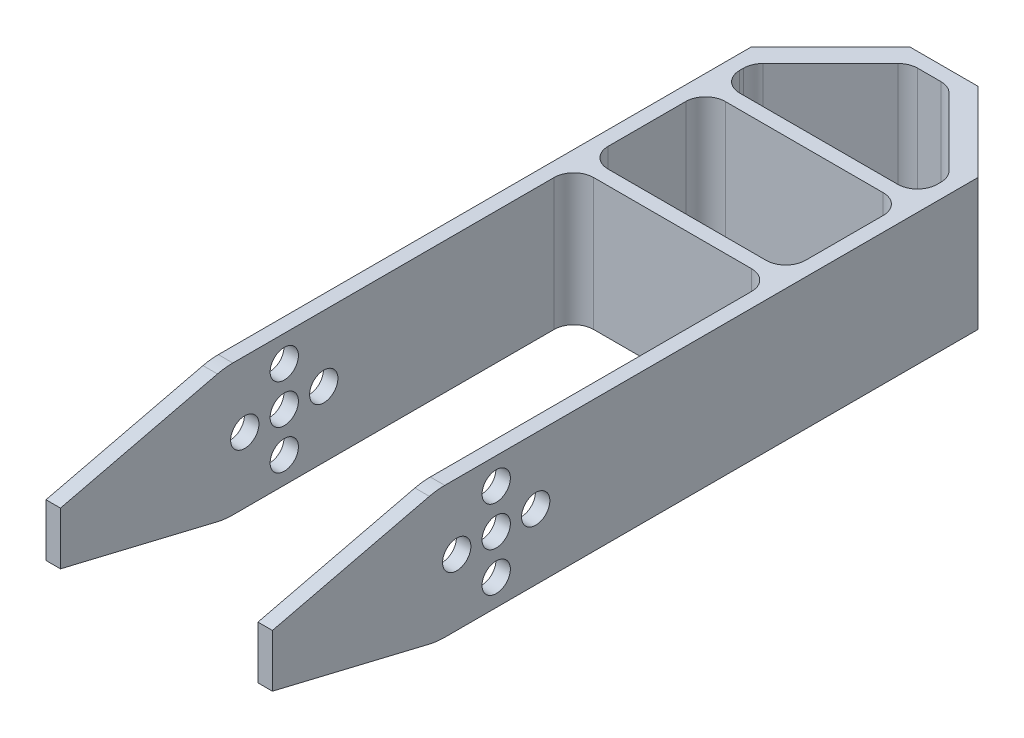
ISO-10303-21;
HEADER;
FILE_DESCRIPTION(('STEP AP214'),'2;1');
FILE_NAME('part.step','',(''),(''),'','','');
FILE_SCHEMA(('AUTOMOTIVE_DESIGN { 1 0 10303 214 1 1 1 1 }'));
ENDSEC;
DATA;
#1=APPLICATION_CONTEXT('core data for automotive mechanical design processes');
#2=APPLICATION_PROTOCOL_DEFINITION('international standard','automotive_design',2000,#1);
#3=PRODUCT_CONTEXT('',#1,'mechanical');
#4=PRODUCT('Part','Part','',(#3));
#5=PRODUCT_RELATED_PRODUCT_CATEGORY('part','',(#4));
#6=PRODUCT_DEFINITION_FORMATION('','',#4);
#7=PRODUCT_DEFINITION_CONTEXT('part definition',#1,'design');
#8=PRODUCT_DEFINITION('design','',#6,#7);
#9=PRODUCT_DEFINITION_SHAPE('','',#8);
#10=(LENGTH_UNIT() NAMED_UNIT(*) SI_UNIT(.MILLI.,.METRE.));
#11=(NAMED_UNIT(*) PLANE_ANGLE_UNIT() SI_UNIT($,.RADIAN.));
#12=(NAMED_UNIT(*) SI_UNIT($,.STERADIAN.) SOLID_ANGLE_UNIT());
#13=UNCERTAINTY_MEASURE_WITH_UNIT(LENGTH_MEASURE(1.E-05),#10,'distance_accuracy_value','');
#14=(GEOMETRIC_REPRESENTATION_CONTEXT(3) GLOBAL_UNCERTAINTY_ASSIGNED_CONTEXT((#13)) GLOBAL_UNIT_ASSIGNED_CONTEXT((#10,
#11,#12)) REPRESENTATION_CONTEXT('',''));
#15=CARTESIAN_POINT('',(0.,0.,0.));
#16=DIRECTION('',(0.,0.,1.));
#17=DIRECTION('',(1.,0.,0.));
#18=AXIS2_PLACEMENT_3D('',#15,#16,#17);
#19=CARTESIAN_POINT('',(32.2,10.,0.));
#20=DIRECTION('',(-1.,0.,0.));
#21=DIRECTION('',(0.,0.,1.));
#22=AXIS2_PLACEMENT_3D('',#19,#20,#21);
#23=PLANE('',#22);
#24=DIRECTION('',(0.,-0.233372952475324,-0.972387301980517));
#25=VECTOR('',#24,1.);
#26=CARTESIAN_POINT('',(32.2,-3.2375189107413,3.17700453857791));
#27=LINE('',#26,#25);
#28=CARTESIAN_POINT('',(32.2,-4.,0.));
#29=VERTEX_POINT('',#28);
#30=CARTESIAN_POINT('',(32.2,-9.72387301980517,-23.8494709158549));
#31=VERTEX_POINT('',#30);
#32=EDGE_CURVE('E341',#29,#31,#27,.T.);
#33=ORIENTED_EDGE('',*,*,#32,.F.);
#34=DIRECTION('',(0.,-1.,0.));
#35=VECTOR('',#34,1.);
#36=CARTESIAN_POINT('',(32.2,10.,0.));
#37=LINE('',#36,#35);
#38=CARTESIAN_POINT('',(32.2,4.,0.));
#39=VERTEX_POINT('',#38);
#40=EDGE_CURVE('E593',#39,#29,#37,.T.);
#41=ORIENTED_EDGE('',*,*,#40,.F.);
#42=DIRECTION('',(0.,-0.233372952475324,0.972387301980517));
#43=VECTOR('',#42,1.);
#44=CARTESIAN_POINT('',(32.2,4.3267776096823,-1.36157337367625));
#45=LINE('',#44,#43);
#46=CARTESIAN_POINT('',(32.2,9.72387301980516,-23.8494709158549));
#47=VERTEX_POINT('',#46);
#48=EDGE_CURVE('E388',#47,#39,#45,.T.);
#49=ORIENTED_EDGE('',*,*,#48,.F.);
#50=CARTESIAN_POINT('',(32.2,0.,-26.1832004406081));
#51=DIRECTION('',(-1.,0.,0.));
#52=DIRECTION('',(0.,0.,1.));
#53=AXIS2_PLACEMENT_3D('',#50,#51,#52);
#54=CIRCLE('',#53,10.);
#55=CARTESIAN_POINT('',(32.2,10.,-26.1832004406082));
#56=VERTEX_POINT('',#55);
#57=EDGE_CURVE('E386',#56,#47,#54,.F.);
#58=ORIENTED_EDGE('',*,*,#57,.F.);
#59=DIRECTION('',(0.,0.,-1.));
#60=VECTOR('',#59,1.);
#61=CARTESIAN_POINT('',(32.2,10.,0.));
#62=LINE('',#61,#60);
#63=CARTESIAN_POINT('',(32.2,10.,-75.));
#64=VERTEX_POINT('',#63);
#65=EDGE_CURVE('E428',#56,#64,#62,.T.);
#66=ORIENTED_EDGE('',*,*,#65,.T.);
#67=DIRECTION('',(0.,-1.,0.));
#68=VECTOR('',#67,1.);
#69=CARTESIAN_POINT('',(32.2,10.,-75.));
#70=LINE('',#69,#68);
#71=CARTESIAN_POINT('',(32.2,-10.,-75.));
#72=VERTEX_POINT('',#71);
#73=EDGE_CURVE('E596',#64,#72,#70,.T.);
#74=ORIENTED_EDGE('',*,*,#73,.T.);
#75=DIRECTION('',(0.,0.,-1.));
#76=VECTOR('',#75,1.);
#77=CARTESIAN_POINT('',(32.2,-10.,0.));
#78=LINE('',#77,#76);
#79=CARTESIAN_POINT('',(32.2,-10.,-26.1832004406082));
#80=VERTEX_POINT('',#79);
#81=EDGE_CURVE('E509',#80,#72,#78,.T.);
#82=ORIENTED_EDGE('',*,*,#81,.F.);
#83=CARTESIAN_POINT('',(32.2,0.,-26.1832004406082));
#84=DIRECTION('',(-1.,0.,0.));
#85=DIRECTION('',(0.,0.,1.));
#86=AXIS2_PLACEMENT_3D('',#83,#84,#85);
#87=CIRCLE('',#86,10.);
#88=EDGE_CURVE('E49',#31,#80,#87,.F.);
#89=ORIENTED_EDGE('',*,*,#88,.F.);
#90=EDGE_LOOP('',(#33,#41,#49,#58,#66,#74,#82,#89));
#91=FACE_BOUND('',#90,.T.);
#92=CARTESIAN_POINT('',(32.2,0.,-34.));
#93=DIRECTION('',(-1.,0.,0.));
#94=DIRECTION('',(0.,0.,1.));
#95=AXIS2_PLACEMENT_3D('',#92,#93,#94);
#96=CIRCLE('',#95,2.15);
#97=CARTESIAN_POINT('',(32.2,0.,-36.15));
#98=VERTEX_POINT('',#97);
#99=EDGE_CURVE('E344',#98,#98,#96,.T.);
#100=ORIENTED_EDGE('',*,*,#99,.F.);
#101=EDGE_LOOP('',(#100));
#102=FACE_BOUND('',#101,.T.);
#103=CARTESIAN_POINT('',(32.2,-6.,-34.));
#104=DIRECTION('',(-1.,0.,0.));
#105=DIRECTION('',(0.,0.,1.));
#106=AXIS2_PLACEMENT_3D('',#103,#104,#105);
#107=CIRCLE('',#106,2.15);
#108=CARTESIAN_POINT('',(32.2,-6.,-36.15));
#109=VERTEX_POINT('',#108);
#110=EDGE_CURVE('E348',#109,#109,#107,.T.);
#111=ORIENTED_EDGE('',*,*,#110,.F.);
#112=EDGE_LOOP('',(#111));
#113=FACE_BOUND('',#112,.T.);
#114=CARTESIAN_POINT('',(32.2,6.,-34.));
#115=DIRECTION('',(-1.,0.,0.));
#116=DIRECTION('',(0.,0.,1.));
#117=AXIS2_PLACEMENT_3D('',#114,#115,#116);
#118=CIRCLE('',#117,2.15);
#119=CARTESIAN_POINT('',(32.2,6.,-36.15));
#120=VERTEX_POINT('',#119);
#121=EDGE_CURVE('E352',#120,#120,#118,.T.);
#122=ORIENTED_EDGE('',*,*,#121,.F.);
#123=EDGE_LOOP('',(#122));
#124=FACE_BOUND('',#123,.T.);
#125=CARTESIAN_POINT('',(32.2,0.,-28.));
#126=DIRECTION('',(-1.,0.,0.));
#127=DIRECTION('',(0.,0.,1.));
#128=AXIS2_PLACEMENT_3D('',#125,#126,#127);
#129=CIRCLE('',#128,2.15);
#130=CARTESIAN_POINT('',(32.2,0.,-30.15));
#131=VERTEX_POINT('',#130);
#132=EDGE_CURVE('E356',#131,#131,#129,.T.);
#133=ORIENTED_EDGE('',*,*,#132,.F.);
#134=EDGE_LOOP('',(#133));
#135=FACE_BOUND('',#134,.T.);
#136=CARTESIAN_POINT('',(32.2,0.,-40.));
#137=DIRECTION('',(-1.,0.,0.));
#138=DIRECTION('',(0.,0.,1.));
#139=AXIS2_PLACEMENT_3D('',#136,#137,#138);
#140=CIRCLE('',#139,2.15);
#141=CARTESIAN_POINT('',(32.2,0.,-42.15));
#142=VERTEX_POINT('',#141);
#143=EDGE_CURVE('E359',#142,#142,#140,.T.);
#144=ORIENTED_EDGE('',*,*,#143,.F.);
#145=EDGE_LOOP('',(#144));
#146=FACE_BOUND('',#145,.T.);
#147=ADVANCED_FACE('F32',(#91,#102,#113,#124,#135,#146),#23,.T.);
#148=CARTESIAN_POINT('',(34.4,10.,0.));
#149=DIRECTION('',(-1.,0.,0.));
#150=DIRECTION('',(0.,0.,1.));
#151=AXIS2_PLACEMENT_3D('',#148,#149,#150);
#152=PLANE('',#151);
#153=CARTESIAN_POINT('',(34.4,0.,-28.));
#154=DIRECTION('',(1.,0.,0.));
#155=DIRECTION('',(0.,0.,-1.));
#156=AXIS2_PLACEMENT_3D('',#153,#154,#155);
#157=CIRCLE('',#156,2.15);
#158=CARTESIAN_POINT('',(34.4,0.,-30.15));
#159=VERTEX_POINT('',#158);
#160=EDGE_CURVE('E1095',#159,#159,#157,.T.);
#161=ORIENTED_EDGE('',*,*,#160,.F.);
#162=EDGE_LOOP('',(#161));
#163=FACE_BOUND('',#162,.T.);
#164=CARTESIAN_POINT('',(34.4,-6.,-34.));
#165=DIRECTION('',(1.,0.,0.));
#166=DIRECTION('',(0.,0.,-1.));
#167=AXIS2_PLACEMENT_3D('',#164,#165,#166);
#168=CIRCLE('',#167,2.15);
#169=CARTESIAN_POINT('',(34.4,-6.,-36.15));
#170=VERTEX_POINT('',#169);
#171=EDGE_CURVE('E335',#170,#170,#168,.T.);
#172=ORIENTED_EDGE('',*,*,#171,.F.);
#173=EDGE_LOOP('',(#172));
#174=FACE_BOUND('',#173,.T.);
#175=DIRECTION('',(0.,-1.,0.));
#176=VECTOR('',#175,1.);
#177=CARTESIAN_POINT('',(34.4,10.,0.));
#178=LINE('',#177,#176);
#179=CARTESIAN_POINT('',(34.4,4.,0.));
#180=VERTEX_POINT('',#179);
#181=CARTESIAN_POINT('',(34.4,-4.,0.));
#182=VERTEX_POINT('',#181);
#183=EDGE_CURVE('E590',#180,#182,#178,.T.);
#184=ORIENTED_EDGE('',*,*,#183,.T.);
#185=DIRECTION('',(0.,0.233372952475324,0.972387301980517));
#186=VECTOR('',#185,1.);
#187=CARTESIAN_POINT('',(34.4,-4.,0.));
#188=LINE('',#187,#186);
#189=CARTESIAN_POINT('',(34.4,-9.72387301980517,-23.8494709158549));
#190=VERTEX_POINT('',#189);
#191=EDGE_CURVE('E314',#190,#182,#188,.T.);
#192=ORIENTED_EDGE('',*,*,#191,.F.);
#193=CARTESIAN_POINT('',(34.4,0.,-26.1832004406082));
#194=DIRECTION('',(-1.,0.,0.));
#195=DIRECTION('',(0.,0.,1.));
#196=AXIS2_PLACEMENT_3D('',#193,#194,#195);
#197=CIRCLE('',#196,10.);
#198=CARTESIAN_POINT('',(34.4,-10.,-26.1832004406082));
#199=VERTEX_POINT('',#198);
#200=EDGE_CURVE('E316',#199,#190,#197,.T.);
#201=ORIENTED_EDGE('',*,*,#200,.F.);
#202=DIRECTION('',(0.,0.,-1.));
#203=VECTOR('',#202,1.);
#204=CARTESIAN_POINT('',(34.4,-10.,0.));
#205=LINE('',#204,#203);
#206=CARTESIAN_POINT('',(34.4,-10.,-107.2));
#207=VERTEX_POINT('',#206);
#208=EDGE_CURVE('E511',#199,#207,#205,.T.);
#209=ORIENTED_EDGE('',*,*,#208,.T.);
#210=DIRECTION('',(0.,-1.,0.));
#211=VECTOR('',#210,1.);
#212=CARTESIAN_POINT('',(34.4,10.,-107.2));
#213=LINE('',#212,#211);
#214=CARTESIAN_POINT('',(34.4,10.,-107.2));
#215=VERTEX_POINT('',#214);
#216=EDGE_CURVE('E587',#215,#207,#213,.T.);
#217=ORIENTED_EDGE('',*,*,#216,.F.);
#218=DIRECTION('',(0.,0.,-1.));
#219=VECTOR('',#218,1.);
#220=CARTESIAN_POINT('',(34.4,10.,0.));
#221=LINE('',#220,#219);
#222=CARTESIAN_POINT('',(34.4,10.,-26.1832004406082));
#223=VERTEX_POINT('',#222);
#224=EDGE_CURVE('E430',#223,#215,#221,.T.);
#225=ORIENTED_EDGE('',*,*,#224,.F.);
#226=CARTESIAN_POINT('',(34.4,0.,-26.1832004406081));
#227=DIRECTION('',(-1.,0.,0.));
#228=DIRECTION('',(0.,0.,1.));
#229=AXIS2_PLACEMENT_3D('',#226,#227,#228);
#230=CIRCLE('',#229,10.);
#231=CARTESIAN_POINT('',(34.4,9.72387301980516,-23.8494709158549));
#232=VERTEX_POINT('',#231);
#233=EDGE_CURVE('E367',#232,#223,#230,.T.);
#234=ORIENTED_EDGE('',*,*,#233,.F.);
#235=DIRECTION('',(0.,0.233372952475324,-0.972387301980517));
#236=VECTOR('',#235,1.);
#237=CARTESIAN_POINT('',(34.4,4.,0.));
#238=LINE('',#237,#236);
#239=EDGE_CURVE('E362',#180,#232,#238,.T.);
#240=ORIENTED_EDGE('',*,*,#239,.F.);
#241=EDGE_LOOP('',(#184,#192,#201,#209,#217,#225,#234,#240));
#242=FACE_BOUND('',#241,.T.);
#243=CARTESIAN_POINT('',(34.4,0.,-34.));
#244=DIRECTION('',(1.,0.,0.));
#245=DIRECTION('',(0.,0.,-1.));
#246=AXIS2_PLACEMENT_3D('',#243,#244,#245);
#247=CIRCLE('',#246,2.15);
#248=CARTESIAN_POINT('',(34.4,0.,-36.15));
#249=VERTEX_POINT('',#248);
#250=EDGE_CURVE('E329',#249,#249,#247,.T.);
#251=ORIENTED_EDGE('',*,*,#250,.F.);
#252=EDGE_LOOP('',(#251));
#253=FACE_BOUND('',#252,.T.);
#254=CARTESIAN_POINT('',(34.4,6.,-34.));
#255=DIRECTION('',(1.,0.,0.));
#256=DIRECTION('',(0.,0.,-1.));
#257=AXIS2_PLACEMENT_3D('',#254,#255,#256);
#258=CIRCLE('',#257,2.15);
#259=CARTESIAN_POINT('',(34.4,6.,-36.15));
#260=VERTEX_POINT('',#259);
#261=EDGE_CURVE('E1104',#260,#260,#258,.T.);
#262=ORIENTED_EDGE('',*,*,#261,.F.);
#263=EDGE_LOOP('',(#262));
#264=FACE_BOUND('',#263,.T.);
#265=CARTESIAN_POINT('',(34.4,0.,-40.));
#266=DIRECTION('',(1.,0.,0.));
#267=DIRECTION('',(0.,0.,-1.));
#268=AXIS2_PLACEMENT_3D('',#265,#266,#267);
#269=CIRCLE('',#268,2.15);
#270=CARTESIAN_POINT('',(34.4,0.,-42.15));
#271=VERTEX_POINT('',#270);
#272=EDGE_CURVE('E319',#271,#271,#269,.T.);
#273=ORIENTED_EDGE('',*,*,#272,.F.);
#274=EDGE_LOOP('',(#273));
#275=FACE_BOUND('',#274,.T.);
#276=ADVANCED_FACE('F664',(#163,#174,#242,#253,#264,#275),#152,.F.);
#277=CARTESIAN_POINT('',(0.,10.,0.));
#278=DIRECTION('',(-1.,0.,0.));
#279=DIRECTION('',(0.,0.,1.));
#280=AXIS2_PLACEMENT_3D('',#277,#278,#279);
#281=PLANE('',#280);
#282=DIRECTION('',(0.,0.233372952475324,0.972387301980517));
#283=VECTOR('',#282,1.);
#284=CARTESIAN_POINT('',(0.,-4.,0.));
#285=LINE('',#284,#283);
#286=CARTESIAN_POINT('',(0.,-9.72387301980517,-23.8494709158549));
#287=VERTEX_POINT('',#286);
#288=CARTESIAN_POINT('',(0.,-4.,0.));
#289=VERTEX_POINT('',#288);
#290=EDGE_CURVE('E300',#287,#289,#285,.T.);
#291=ORIENTED_EDGE('',*,*,#290,.T.);
#292=DIRECTION('',(0.,-1.,0.));
#293=VECTOR('',#292,1.);
#294=CARTESIAN_POINT('',(0.,10.,0.));
#295=LINE('',#294,#293);
#296=CARTESIAN_POINT('',(0.,4.,0.));
#297=VERTEX_POINT('',#296);
#298=EDGE_CURVE('E579',#297,#289,#295,.T.);
#299=ORIENTED_EDGE('',*,*,#298,.F.);
#300=DIRECTION('',(0.,0.233372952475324,-0.972387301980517));
#301=VECTOR('',#300,1.);
#302=CARTESIAN_POINT('',(0.,4.,0.));
#303=LINE('',#302,#301);
#304=CARTESIAN_POINT('',(0.,9.72387301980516,-23.8494709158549));
#305=VERTEX_POINT('',#304);
#306=EDGE_CURVE('E363',#297,#305,#303,.T.);
#307=ORIENTED_EDGE('',*,*,#306,.T.);
#308=CARTESIAN_POINT('',(0.,0.,-26.1832004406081));
#309=DIRECTION('',(-1.,0.,0.));
#310=DIRECTION('',(0.,0.,1.));
#311=AXIS2_PLACEMENT_3D('',#308,#309,#310);
#312=CIRCLE('',#311,10.);
#313=CARTESIAN_POINT('',(0.,10.,-26.1832004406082));
#314=VERTEX_POINT('',#313);
#315=EDGE_CURVE('E366',#305,#314,#312,.T.);
#316=ORIENTED_EDGE('',*,*,#315,.T.);
#317=DIRECTION('',(0.,0.,-1.));
#318=VECTOR('',#317,1.);
#319=CARTESIAN_POINT('',(0.,10.,0.));
#320=LINE('',#319,#318);
#321=CARTESIAN_POINT('',(0.,10.,-107.2));
#322=VERTEX_POINT('',#321);
#323=EDGE_CURVE('E441',#314,#322,#320,.T.);
#324=ORIENTED_EDGE('',*,*,#323,.T.);
#325=DIRECTION('',(0.,-1.,0.));
#326=VECTOR('',#325,1.);
#327=CARTESIAN_POINT('',(0.,10.,-107.2));
#328=LINE('',#327,#326);
#329=CARTESIAN_POINT('',(0.,-10.,-107.2));
#330=VERTEX_POINT('',#329);
#331=EDGE_CURVE('E581',#322,#330,#328,.T.);
#332=ORIENTED_EDGE('',*,*,#331,.T.);
#333=DIRECTION('',(0.,0.,-1.));
#334=VECTOR('',#333,1.);
#335=CARTESIAN_POINT('',(0.,-10.,0.));
#336=LINE('',#335,#334);
#337=CARTESIAN_POINT('',(0.,-10.,-26.1832004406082));
#338=VERTEX_POINT('',#337);
#339=EDGE_CURVE('E313',#338,#330,#336,.T.);
#340=ORIENTED_EDGE('',*,*,#339,.F.);
#341=CARTESIAN_POINT('',(0.,0.,-26.1832004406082));
#342=DIRECTION('',(-1.,0.,0.));
#343=DIRECTION('',(0.,0.,1.));
#344=AXIS2_PLACEMENT_3D('',#341,#342,#343);
#345=CIRCLE('',#344,10.);
#346=EDGE_CURVE('E57',#338,#287,#345,.T.);
#347=ORIENTED_EDGE('',*,*,#346,.T.);
#348=EDGE_LOOP('',(#291,#299,#307,#316,#324,#332,#340,#347));
#349=FACE_BOUND('',#348,.T.);
#350=CARTESIAN_POINT('',(0.,0.,-34.));
#351=DIRECTION('',(1.,0.,0.));
#352=DIRECTION('',(0.,0.,-1.));
#353=AXIS2_PLACEMENT_3D('',#350,#351,#352);
#354=CIRCLE('',#353,2.15);
#355=CARTESIAN_POINT('',(0.,0.,-36.15));
#356=VERTEX_POINT('',#355);
#357=EDGE_CURVE('E323',#356,#356,#354,.T.);
#358=ORIENTED_EDGE('',*,*,#357,.T.);
#359=EDGE_LOOP('',(#358));
#360=FACE_BOUND('',#359,.T.);
#361=CARTESIAN_POINT('',(0.,-6.,-34.));
#362=DIRECTION('',(1.,0.,0.));
#363=DIRECTION('',(0.,0.,-1.));
#364=AXIS2_PLACEMENT_3D('',#361,#362,#363);
#365=CIRCLE('',#364,2.15);
#366=CARTESIAN_POINT('',(0.,-6.,-36.15));
#367=VERTEX_POINT('',#366);
#368=EDGE_CURVE('E332',#367,#367,#365,.T.);
#369=ORIENTED_EDGE('',*,*,#368,.T.);
#370=EDGE_LOOP('',(#369));
#371=FACE_BOUND('',#370,.T.);
#372=CARTESIAN_POINT('',(0.,6.,-34.));
#373=DIRECTION('',(1.,0.,0.));
#374=DIRECTION('',(0.,0.,-1.));
#375=AXIS2_PLACEMENT_3D('',#372,#373,#374);
#376=CIRCLE('',#375,2.15);
#377=CARTESIAN_POINT('',(0.,6.,-36.15));
#378=VERTEX_POINT('',#377);
#379=EDGE_CURVE('E338',#378,#378,#376,.T.);
#380=ORIENTED_EDGE('',*,*,#379,.T.);
#381=EDGE_LOOP('',(#380));
#382=FACE_BOUND('',#381,.T.);
#383=CARTESIAN_POINT('',(0.,0.,-28.));
#384=DIRECTION('',(1.,0.,0.));
#385=DIRECTION('',(0.,0.,-1.));
#386=AXIS2_PLACEMENT_3D('',#383,#384,#385);
#387=CIRCLE('',#386,2.15);
#388=CARTESIAN_POINT('',(0.,0.,-30.15));
#389=VERTEX_POINT('',#388);
#390=EDGE_CURVE('E1099',#389,#389,#387,.T.);
#391=ORIENTED_EDGE('',*,*,#390,.T.);
#392=EDGE_LOOP('',(#391));
#393=FACE_BOUND('',#392,.T.);
#394=CARTESIAN_POINT('',(0.,0.,-40.));
#395=DIRECTION('',(1.,0.,0.));
#396=DIRECTION('',(0.,0.,-1.));
#397=AXIS2_PLACEMENT_3D('',#394,#395,#396);
#398=CIRCLE('',#397,2.15);
#399=CARTESIAN_POINT('',(0.,0.,-42.15));
#400=VERTEX_POINT('',#399);
#401=EDGE_CURVE('E1093',#400,#400,#398,.T.);
#402=ORIENTED_EDGE('',*,*,#401,.T.);
#403=EDGE_LOOP('',(#402));
#404=FACE_BOUND('',#403,.T.);
#405=ADVANCED_FACE('F310',(#349,#360,#371,#382,#393,#404),#281,.T.);
#406=CARTESIAN_POINT('',(2.2,10.,0.));
#407=DIRECTION('',(-1.,0.,0.));
#408=DIRECTION('',(0.,0.,1.));
#409=AXIS2_PLACEMENT_3D('',#406,#407,#408);
#410=PLANE('',#409);
#411=CARTESIAN_POINT('',(2.2,0.,-28.));
#412=DIRECTION('',(-1.,0.,0.));
#413=DIRECTION('',(0.,0.,1.));
#414=AXIS2_PLACEMENT_3D('',#411,#412,#413);
#415=CIRCLE('',#414,2.15);
#416=CARTESIAN_POINT('',(2.2,0.,-30.15));
#417=VERTEX_POINT('',#416);
#418=EDGE_CURVE('E355',#417,#417,#415,.T.);
#419=ORIENTED_EDGE('',*,*,#418,.T.);
#420=EDGE_LOOP('',(#419));
#421=FACE_BOUND('',#420,.T.);
#422=CARTESIAN_POINT('',(2.2,-6.,-34.));
#423=DIRECTION('',(-1.,0.,0.));
#424=DIRECTION('',(0.,0.,1.));
#425=AXIS2_PLACEMENT_3D('',#422,#423,#424);
#426=CIRCLE('',#425,2.15);
#427=CARTESIAN_POINT('',(2.2,-6.,-36.15));
#428=VERTEX_POINT('',#427);
#429=EDGE_CURVE('E347',#428,#428,#426,.T.);
#430=ORIENTED_EDGE('',*,*,#429,.T.);
#431=EDGE_LOOP('',(#430));
#432=FACE_BOUND('',#431,.T.);
#433=DIRECTION('',(0.,-1.,0.));
#434=VECTOR('',#433,1.);
#435=CARTESIAN_POINT('',(2.2,10.,0.));
#436=LINE('',#435,#434);
#437=CARTESIAN_POINT('',(2.2,4.,0.));
#438=VERTEX_POINT('',#437);
#439=CARTESIAN_POINT('',(2.2,-4.,0.));
#440=VERTEX_POINT('',#439);
#441=EDGE_CURVE('E576',#438,#440,#436,.T.);
#442=ORIENTED_EDGE('',*,*,#441,.T.);
#443=DIRECTION('',(0.,-0.233372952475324,-0.972387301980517));
#444=VECTOR('',#443,1.);
#445=CARTESIAN_POINT('',(2.2,-3.2375189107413,3.17700453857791));
#446=LINE('',#445,#444);
#447=CARTESIAN_POINT('',(2.2,-9.72387301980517,-23.8494709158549));
#448=VERTEX_POINT('',#447);
#449=EDGE_CURVE('E11',#440,#448,#446,.T.);
#450=ORIENTED_EDGE('',*,*,#449,.T.);
#451=CARTESIAN_POINT('',(2.2,0.,-26.1832004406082));
#452=DIRECTION('',(-1.,0.,0.));
#453=DIRECTION('',(0.,0.,1.));
#454=AXIS2_PLACEMENT_3D('',#451,#452,#453);
#455=CIRCLE('',#454,10.);
#456=CARTESIAN_POINT('',(2.2,-10.,-26.1832004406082));
#457=VERTEX_POINT('',#456);
#458=EDGE_CURVE('E294',#448,#457,#455,.F.);
#459=ORIENTED_EDGE('',*,*,#458,.T.);
#460=DIRECTION('',(0.,0.,-1.));
#461=VECTOR('',#460,1.);
#462=CARTESIAN_POINT('',(2.2,-10.,0.));
#463=LINE('',#462,#461);
#464=CARTESIAN_POINT('',(2.2,-10.,-75.));
#465=VERTEX_POINT('',#464);
#466=EDGE_CURVE('E523',#457,#465,#463,.T.);
#467=ORIENTED_EDGE('',*,*,#466,.T.);
#468=DIRECTION('',(0.,-1.,0.));
#469=VECTOR('',#468,1.);
#470=CARTESIAN_POINT('',(2.2,10.,-75.));
#471=LINE('',#470,#469);
#472=CARTESIAN_POINT('',(2.2,10.,-75.));
#473=VERTEX_POINT('',#472);
#474=EDGE_CURVE('E572',#473,#465,#471,.T.);
#475=ORIENTED_EDGE('',*,*,#474,.F.);
#476=DIRECTION('',(0.,0.,-1.));
#477=VECTOR('',#476,1.);
#478=CARTESIAN_POINT('',(2.2,10.,0.));
#479=LINE('',#478,#477);
#480=CARTESIAN_POINT('',(2.2,10.,-26.1832004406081));
#481=VERTEX_POINT('',#480);
#482=EDGE_CURVE('E443',#481,#473,#479,.T.);
#483=ORIENTED_EDGE('',*,*,#482,.F.);
#484=CARTESIAN_POINT('',(2.2,0.,-26.1832004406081));
#485=DIRECTION('',(-1.,0.,0.));
#486=DIRECTION('',(0.,0.,1.));
#487=AXIS2_PLACEMENT_3D('',#484,#485,#486);
#488=CIRCLE('',#487,10.);
#489=CARTESIAN_POINT('',(2.2,9.72387301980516,-23.8494709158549));
#490=VERTEX_POINT('',#489);
#491=EDGE_CURVE('E377',#481,#490,#488,.F.);
#492=ORIENTED_EDGE('',*,*,#491,.T.);
#493=DIRECTION('',(0.,-0.233372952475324,0.972387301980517));
#494=VECTOR('',#493,1.);
#495=CARTESIAN_POINT('',(2.2,4.3267776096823,-1.36157337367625));
#496=LINE('',#495,#494);
#497=EDGE_CURVE('E626',#490,#438,#496,.T.);
#498=ORIENTED_EDGE('',*,*,#497,.T.);
#499=EDGE_LOOP('',(#442,#450,#459,#467,#475,#483,#492,#498));
#500=FACE_BOUND('',#499,.T.);
#501=CARTESIAN_POINT('',(2.2,0.,-34.));
#502=DIRECTION('',(-1.,0.,0.));
#503=DIRECTION('',(0.,0.,1.));
#504=AXIS2_PLACEMENT_3D('',#501,#502,#503);
#505=CIRCLE('',#504,2.15);
#506=CARTESIAN_POINT('',(2.2,0.,-36.15));
#507=VERTEX_POINT('',#506);
#508=EDGE_CURVE('E343',#507,#507,#505,.T.);
#509=ORIENTED_EDGE('',*,*,#508,.T.);
#510=EDGE_LOOP('',(#509));
#511=FACE_BOUND('',#510,.T.);
#512=CARTESIAN_POINT('',(2.2,6.,-34.));
#513=DIRECTION('',(-1.,0.,0.));
#514=DIRECTION('',(0.,0.,1.));
#515=AXIS2_PLACEMENT_3D('',#512,#513,#514);
#516=CIRCLE('',#515,2.15);
#517=CARTESIAN_POINT('',(2.2,6.,-36.15));
#518=VERTEX_POINT('',#517);
#519=EDGE_CURVE('E351',#518,#518,#516,.T.);
#520=ORIENTED_EDGE('',*,*,#519,.T.);
#521=EDGE_LOOP('',(#520));
#522=FACE_BOUND('',#521,.T.);
#523=CARTESIAN_POINT('',(2.2,0.,-40.));
#524=DIRECTION('',(-1.,0.,0.));
#525=DIRECTION('',(0.,0.,1.));
#526=AXIS2_PLACEMENT_3D('',#523,#524,#525);
#527=CIRCLE('',#526,2.15);
#528=CARTESIAN_POINT('',(2.2,0.,-42.15));
#529=VERTEX_POINT('',#528);
#530=EDGE_CURVE('E36',#529,#529,#527,.T.);
#531=ORIENTED_EDGE('',*,*,#530,.T.);
#532=EDGE_LOOP('',(#531));
#533=FACE_BOUND('',#532,.T.);
#534=ADVANCED_FACE('F638',(#421,#432,#500,#511,#522,#533),#410,.F.);
#535=CARTESIAN_POINT('',(0.,10.,-98.));
#536=DIRECTION('',(0.,0.,-1.));
#537=DIRECTION('',(-1.,0.,0.));
#538=AXIS2_PLACEMENT_3D('',#535,#536,#537);
#539=PLANE('',#538);
#540=DIRECTION('',(1.,0.,0.));
#541=VECTOR('',#540,1.);
#542=CARTESIAN_POINT('',(0.,-10.,-98.));
#543=LINE('',#542,#541);
#544=CARTESIAN_POINT('',(5.20000000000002,-10.,-98.));
#545=VERTEX_POINT('',#544);
#546=CARTESIAN_POINT('',(29.2,-10.,-98.));
#547=VERTEX_POINT('',#546);
#548=EDGE_CURVE('E527',#545,#547,#543,.T.);
#549=ORIENTED_EDGE('',*,*,#548,.T.);
#550=DIRECTION('',(0.,-1.,0.));
#551=VECTOR('',#550,1.);
#552=CARTESIAN_POINT('',(29.2,10.,-98.));
#553=LINE('',#552,#551);
#554=CARTESIAN_POINT('',(29.2,10.,-98.));
#555=VERTEX_POINT('',#554);
#556=EDGE_CURVE('E565',#555,#547,#553,.T.);
#557=ORIENTED_EDGE('',*,*,#556,.F.);
#558=DIRECTION('',(1.,0.,0.));
#559=VECTOR('',#558,1.);
#560=CARTESIAN_POINT('',(0.,10.,-98.));
#561=LINE('',#560,#559);
#562=CARTESIAN_POINT('',(5.20000000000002,10.,-98.));
#563=VERTEX_POINT('',#562);
#564=EDGE_CURVE('E447',#563,#555,#561,.T.);
#565=ORIENTED_EDGE('',*,*,#564,.F.);
#566=DIRECTION('',(0.,-1.,0.));
#567=VECTOR('',#566,1.);
#568=CARTESIAN_POINT('',(5.20000000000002,10.,-98.));
#569=LINE('',#568,#567);
#570=EDGE_CURVE('E549',#563,#545,#569,.T.);
#571=ORIENTED_EDGE('',*,*,#570,.T.);
#572=EDGE_LOOP('',(#549,#557,#565,#571));
#573=FACE_BOUND('',#572,.T.);
#574=ADVANCED_FACE('F780',(#573),#539,.F.);
#575=CARTESIAN_POINT('',(29.2,10.,-95.));
#576=DIRECTION('',(0.,-1.,0.));
#577=DIRECTION('',(0.,0.,-1.));
#578=AXIS2_PLACEMENT_3D('',#575,#576,#577);
#579=CYLINDRICAL_SURFACE('',#578,3.);
#580=CARTESIAN_POINT('',(29.2,-10.,-95.));
#581=DIRECTION('',(0.,1.,0.));
#582=DIRECTION('',(0.,0.,1.));
#583=AXIS2_PLACEMENT_3D('',#580,#581,#582);
#584=CIRCLE('',#583,3.);
#585=CARTESIAN_POINT('',(32.2,-10.,-95.));
#586=VERTEX_POINT('',#585);
#587=EDGE_CURVE('E530',#547,#586,#584,.F.);
#588=ORIENTED_EDGE('',*,*,#587,.T.);
#589=DIRECTION('',(0.,-1.,0.));
#590=VECTOR('',#589,1.);
#591=CARTESIAN_POINT('',(32.2,10.,-95.));
#592=LINE('',#591,#590);
#593=CARTESIAN_POINT('',(32.2,10.,-95.));
#594=VERTEX_POINT('',#593);
#595=EDGE_CURVE('E562',#594,#586,#592,.T.);
#596=ORIENTED_EDGE('',*,*,#595,.F.);
#597=CARTESIAN_POINT('',(29.2,10.,-95.));
#598=DIRECTION('',(0.,1.,0.));
#599=DIRECTION('',(0.,0.,1.));
#600=AXIS2_PLACEMENT_3D('',#597,#598,#599);
#601=CIRCLE('',#600,3.);
#602=EDGE_CURVE('E450',#555,#594,#601,.F.);
#603=ORIENTED_EDGE('',*,*,#602,.F.);
#604=ORIENTED_EDGE('',*,*,#556,.T.);
#605=EDGE_LOOP('',(#588,#596,#603,#604));
#606=FACE_BOUND('',#605,.T.);
#607=ADVANCED_FACE('F783',(#606),#579,.F.);
#608=CARTESIAN_POINT('',(32.2,10.,0.));
#609=DIRECTION('',(1.,0.,0.));
#610=DIRECTION('',(0.,0.,-1.));
#611=AXIS2_PLACEMENT_3D('',#608,#609,#610);
#612=PLANE('',#611);
#613=DIRECTION('',(0.,0.,1.));
#614=VECTOR('',#613,1.);
#615=CARTESIAN_POINT('',(32.2,-10.,0.));
#616=LINE('',#615,#614);
#617=CARTESIAN_POINT('',(32.2,-10.,-83.2));
#618=VERTEX_POINT('',#617);
#619=EDGE_CURVE('E532',#586,#618,#616,.T.);
#620=ORIENTED_EDGE('',*,*,#619,.T.);
#621=DIRECTION('',(0.,-1.,0.));
#622=VECTOR('',#621,1.);
#623=CARTESIAN_POINT('',(32.2,10.,-83.2));
#624=LINE('',#623,#622);
#625=CARTESIAN_POINT('',(32.2,10.,-83.2));
#626=VERTEX_POINT('',#625);
#627=EDGE_CURVE('E560',#626,#618,#624,.T.);
#628=ORIENTED_EDGE('',*,*,#627,.F.);
#629=DIRECTION('',(0.,0.,1.));
#630=VECTOR('',#629,1.);
#631=CARTESIAN_POINT('',(32.2,10.,0.));
#632=LINE('',#631,#630);
#633=EDGE_CURVE('E452',#594,#626,#632,.T.);
#634=ORIENTED_EDGE('',*,*,#633,.F.);
#635=ORIENTED_EDGE('',*,*,#595,.T.);
#636=EDGE_LOOP('',(#620,#628,#634,#635));
#637=FACE_BOUND('',#636,.T.);
#638=ADVANCED_FACE('F788',(#637),#612,.F.);
#639=CARTESIAN_POINT('',(29.2,10.,-83.2));
#640=DIRECTION('',(0.,-1.,0.));
#641=DIRECTION('',(0.,0.,-1.));
#642=AXIS2_PLACEMENT_3D('',#639,#640,#641);
#643=CYLINDRICAL_SURFACE('',#642,3.);
#644=CARTESIAN_POINT('',(29.2,-10.,-83.2));
#645=DIRECTION('',(0.,1.,0.));
#646=DIRECTION('',(0.,0.,1.));
#647=AXIS2_PLACEMENT_3D('',#644,#645,#646);
#648=CIRCLE('',#647,3.);
#649=CARTESIAN_POINT('',(29.2,-10.,-80.2));
#650=VERTEX_POINT('',#649);
#651=EDGE_CURVE('E535',#650,#618,#648,.T.);
#652=ORIENTED_EDGE('',*,*,#651,.F.);
#653=DIRECTION('',(0.,-1.,0.));
#654=VECTOR('',#653,1.);
#655=CARTESIAN_POINT('',(29.2,10.,-80.2));
#656=LINE('',#655,#654);
#657=CARTESIAN_POINT('',(29.2,10.,-80.2));
#658=VERTEX_POINT('',#657);
#659=EDGE_CURVE('E558',#658,#650,#656,.T.);
#660=ORIENTED_EDGE('',*,*,#659,.F.);
#661=CARTESIAN_POINT('',(29.2,10.,-83.2));
#662=DIRECTION('',(0.,1.,0.));
#663=DIRECTION('',(0.,0.,1.));
#664=AXIS2_PLACEMENT_3D('',#661,#662,#663);
#665=CIRCLE('',#664,3.);
#666=EDGE_CURVE('E454',#658,#626,#665,.T.);
#667=ORIENTED_EDGE('',*,*,#666,.T.);
#668=ORIENTED_EDGE('',*,*,#627,.T.);
#669=EDGE_LOOP('',(#652,#660,#667,#668));
#670=FACE_BOUND('',#669,.T.);
#671=ADVANCED_FACE('F805',(#670),#643,.F.);
#672=CARTESIAN_POINT('',(0.,10.,-80.2));
#673=DIRECTION('',(0.,0.,-1.));
#674=DIRECTION('',(-1.,0.,0.));
#675=AXIS2_PLACEMENT_3D('',#672,#673,#674);
#676=PLANE('',#675);
#677=DIRECTION('',(1.,0.,0.));
#678=VECTOR('',#677,1.);
#679=CARTESIAN_POINT('',(0.,-10.,-80.2));
#680=LINE('',#679,#678);
#681=CARTESIAN_POINT('',(5.20000000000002,-10.,-80.2));
#682=VERTEX_POINT('',#681);
#683=EDGE_CURVE('E538',#682,#650,#680,.T.);
#684=ORIENTED_EDGE('',*,*,#683,.F.);
#685=DIRECTION('',(0.,-1.,0.));
#686=VECTOR('',#685,1.);
#687=CARTESIAN_POINT('',(5.20000000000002,10.,-80.2));
#688=LINE('',#687,#686);
#689=CARTESIAN_POINT('',(5.20000000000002,10.,-80.2));
#690=VERTEX_POINT('',#689);
#691=EDGE_CURVE('E556',#690,#682,#688,.T.);
#692=ORIENTED_EDGE('',*,*,#691,.F.);
#693=DIRECTION('',(1.,0.,0.));
#694=VECTOR('',#693,1.);
#695=CARTESIAN_POINT('',(0.,10.,-80.2));
#696=LINE('',#695,#694);
#697=EDGE_CURVE('E457',#690,#658,#696,.T.);
#698=ORIENTED_EDGE('',*,*,#697,.T.);
#699=ORIENTED_EDGE('',*,*,#659,.T.);
#700=EDGE_LOOP('',(#684,#692,#698,#699));
#701=FACE_BOUND('',#700,.T.);
#702=ADVANCED_FACE('F795',(#701),#676,.T.);
#703=CARTESIAN_POINT('',(5.2,10.,-83.2));
#704=DIRECTION('',(0.,-1.,0.));
#705=DIRECTION('',(0.,0.,-1.));
#706=AXIS2_PLACEMENT_3D('',#703,#704,#705);
#707=CYLINDRICAL_SURFACE('',#706,3.);
#708=CARTESIAN_POINT('',(5.2,-10.,-83.2));
#709=DIRECTION('',(0.,1.,0.));
#710=DIRECTION('',(0.,0.,1.));
#711=AXIS2_PLACEMENT_3D('',#708,#709,#710);
#712=CIRCLE('',#711,3.);
#713=CARTESIAN_POINT('',(2.2,-10.,-83.2));
#714=VERTEX_POINT('',#713);
#715=EDGE_CURVE('E541',#714,#682,#712,.T.);
#716=ORIENTED_EDGE('',*,*,#715,.F.);
#717=DIRECTION('',(0.,-1.,0.));
#718=VECTOR('',#717,1.);
#719=CARTESIAN_POINT('',(2.2,10.,-83.2));
#720=LINE('',#719,#718);
#721=CARTESIAN_POINT('',(2.2,10.,-83.2));
#722=VERTEX_POINT('',#721);
#723=EDGE_CURVE('E554',#722,#714,#720,.T.);
#724=ORIENTED_EDGE('',*,*,#723,.F.);
#725=CARTESIAN_POINT('',(5.2,10.,-83.2));
#726=DIRECTION('',(0.,1.,0.));
#727=DIRECTION('',(0.,0.,1.));
#728=AXIS2_PLACEMENT_3D('',#725,#726,#727);
#729=CIRCLE('',#728,3.);
#730=EDGE_CURVE('E460',#722,#690,#729,.T.);
#731=ORIENTED_EDGE('',*,*,#730,.T.);
#732=ORIENTED_EDGE('',*,*,#691,.T.);
#733=EDGE_LOOP('',(#716,#724,#731,#732));
#734=FACE_BOUND('',#733,.T.);
#735=ADVANCED_FACE('F799',(#734),#707,.F.);
#736=CARTESIAN_POINT('',(2.20000000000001,10.,0.));
#737=DIRECTION('',(1.,0.,0.));
#738=DIRECTION('',(0.,0.,-1.));
#739=AXIS2_PLACEMENT_3D('',#736,#737,#738);
#740=PLANE('',#739);
#741=DIRECTION('',(0.,0.,1.));
#742=VECTOR('',#741,1.);
#743=CARTESIAN_POINT('',(2.20000000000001,-10.,0.));
#744=LINE('',#743,#742);
#745=CARTESIAN_POINT('',(2.19999999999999,-10.,-95.));
#746=VERTEX_POINT('',#745);
#747=EDGE_CURVE('E544',#746,#714,#744,.T.);
#748=ORIENTED_EDGE('',*,*,#747,.F.);
#749=DIRECTION('',(0.,-1.,0.));
#750=VECTOR('',#749,1.);
#751=CARTESIAN_POINT('',(2.19999999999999,10.,-95.));
#752=LINE('',#751,#750);
#753=CARTESIAN_POINT('',(2.19999999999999,10.,-95.));
#754=VERTEX_POINT('',#753);
#755=EDGE_CURVE('E551',#754,#746,#752,.T.);
#756=ORIENTED_EDGE('',*,*,#755,.F.);
#757=DIRECTION('',(0.,0.,1.));
#758=VECTOR('',#757,1.);
#759=CARTESIAN_POINT('',(2.20000000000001,10.,0.));
#760=LINE('',#759,#758);
#761=EDGE_CURVE('E463',#754,#722,#760,.T.);
#762=ORIENTED_EDGE('',*,*,#761,.T.);
#763=ORIENTED_EDGE('',*,*,#723,.T.);
#764=EDGE_LOOP('',(#748,#756,#762,#763));
#765=FACE_BOUND('',#764,.T.);
#766=ADVANCED_FACE('F684',(#765),#740,.T.);
#767=CARTESIAN_POINT('',(0.,10.,-78.));
#768=DIRECTION('',(0.,0.,-1.));
#769=DIRECTION('',(-1.,0.,0.));
#770=AXIS2_PLACEMENT_3D('',#767,#768,#769);
#771=PLANE('',#770);
#772=DIRECTION('',(1.,0.,0.));
#773=VECTOR('',#772,1.);
#774=CARTESIAN_POINT('',(0.,-10.,-78.));
#775=LINE('',#774,#773);
#776=CARTESIAN_POINT('',(5.20000000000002,-10.,-78.));
#777=VERTEX_POINT('',#776);
#778=CARTESIAN_POINT('',(29.2,-10.,-78.));
#779=VERTEX_POINT('',#778);
#780=EDGE_CURVE('E503',#777,#779,#775,.T.);
#781=ORIENTED_EDGE('',*,*,#780,.T.);
#782=DIRECTION('',(0.,-1.,0.));
#783=VECTOR('',#782,1.);
#784=CARTESIAN_POINT('',(29.2,10.,-78.));
#785=LINE('',#784,#783);
#786=CARTESIAN_POINT('',(29.2,10.,-78.));
#787=VERTEX_POINT('',#786);
#788=EDGE_CURVE('E552',#787,#779,#785,.T.);
#789=ORIENTED_EDGE('',*,*,#788,.F.);
#790=DIRECTION('',(1.,0.,0.));
#791=VECTOR('',#790,1.);
#792=CARTESIAN_POINT('',(0.,10.,-78.));
#793=LINE('',#792,#791);
#794=CARTESIAN_POINT('',(5.20000000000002,10.,-78.));
#795=VERTEX_POINT('',#794);
#796=EDGE_CURVE('E422',#795,#787,#793,.T.);
#797=ORIENTED_EDGE('',*,*,#796,.F.);
#798=DIRECTION('',(0.,-1.,0.));
#799=VECTOR('',#798,1.);
#800=CARTESIAN_POINT('',(5.20000000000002,10.,-78.));
#801=LINE('',#800,#799);
#802=EDGE_CURVE('E569',#795,#777,#801,.T.);
#803=ORIENTED_EDGE('',*,*,#802,.T.);
#804=EDGE_LOOP('',(#781,#789,#797,#803));
#805=FACE_BOUND('',#804,.T.);
#806=ADVANCED_FACE('F680',(#805),#771,.F.);
#807=CARTESIAN_POINT('',(29.2,10.,-75.));
#808=DIRECTION('',(0.,-1.,0.));
#809=DIRECTION('',(0.,0.,-1.));
#810=AXIS2_PLACEMENT_3D('',#807,#808,#809);
#811=CYLINDRICAL_SURFACE('',#810,3.);
#812=CARTESIAN_POINT('',(29.2,-10.,-75.));
#813=DIRECTION('',(0.,1.,0.));
#814=DIRECTION('',(0.,0.,1.));
#815=AXIS2_PLACEMENT_3D('',#812,#813,#814);
#816=CIRCLE('',#815,3.);
#817=EDGE_CURVE('E506',#779,#72,#816,.F.);
#818=ORIENTED_EDGE('',*,*,#817,.T.);
#819=ORIENTED_EDGE('',*,*,#73,.F.);
#820=CARTESIAN_POINT('',(29.2,10.,-75.));
#821=DIRECTION('',(0.,1.,0.));
#822=DIRECTION('',(0.,0.,1.));
#823=AXIS2_PLACEMENT_3D('',#820,#821,#822);
#824=CIRCLE('',#823,3.);
#825=EDGE_CURVE('E425',#787,#64,#824,.F.);
#826=ORIENTED_EDGE('',*,*,#825,.F.);
#827=ORIENTED_EDGE('',*,*,#788,.T.);
#828=EDGE_LOOP('',(#818,#819,#826,#827));
#829=FACE_BOUND('',#828,.T.);
#830=ADVANCED_FACE('F677',(#829),#811,.F.);
#831=CARTESIAN_POINT('',(0.,10.,0.));
#832=DIRECTION('',(0.,0.,-1.));
#833=DIRECTION('',(-1.,0.,0.));
#834=AXIS2_PLACEMENT_3D('',#831,#832,#833);
#835=PLANE('',#834);
#836=ORIENTED_EDGE('',*,*,#40,.T.);
#837=DIRECTION('',(1.,0.,0.));
#838=VECTOR('',#837,1.);
#839=CARTESIAN_POINT('',(0.,-4.,0.));
#840=LINE('',#839,#838);
#841=EDGE_CURVE('E296',#29,#182,#840,.T.);
#842=ORIENTED_EDGE('',*,*,#841,.T.);
#843=ORIENTED_EDGE('',*,*,#183,.F.);
#844=DIRECTION('',(1.,0.,0.));
#845=VECTOR('',#844,1.);
#846=CARTESIAN_POINT('',(0.,4.,0.));
#847=LINE('',#846,#845);
#848=EDGE_CURVE('E370',#39,#180,#847,.T.);
#849=ORIENTED_EDGE('',*,*,#848,.F.);
#850=EDGE_LOOP('',(#836,#842,#843,#849));
#851=FACE_BOUND('',#850,.T.);
#852=ADVANCED_FACE('F676',(#851),#835,.F.);
#853=CARTESIAN_POINT('',(70.8,10.,-70.8));
#854=DIRECTION('',(0.707106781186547,0.,-0.707106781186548));
#855=DIRECTION('',(-0.707106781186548,0.,-0.707106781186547));
#856=AXIS2_PLACEMENT_3D('',#853,#854,#855);
#857=PLANE('',#856);
#858=DIRECTION('',(0.707106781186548,0.,0.707106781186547));
#859=VECTOR('',#858,1.);
#860=CARTESIAN_POINT('',(70.8,-10.,-70.8));
#861=LINE('',#860,#859);
#862=CARTESIAN_POINT('',(22.4,-10.,-119.2));
#863=VERTEX_POINT('',#862);
#864=EDGE_CURVE('E513',#863,#207,#861,.T.);
#865=ORIENTED_EDGE('',*,*,#864,.F.);
#866=DIRECTION('',(0.,-1.,0.));
#867=VECTOR('',#866,1.);
#868=CARTESIAN_POINT('',(22.4,10.,-119.2));
#869=LINE('',#868,#867);
#870=CARTESIAN_POINT('',(22.4,10.,-119.2));
#871=VERTEX_POINT('',#870);
#872=EDGE_CURVE('E585',#871,#863,#869,.T.);
#873=ORIENTED_EDGE('',*,*,#872,.F.);
#874=DIRECTION('',(0.707106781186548,0.,0.707106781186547));
#875=VECTOR('',#874,1.);
#876=CARTESIAN_POINT('',(70.8,10.,-70.8));
#877=LINE('',#876,#875);
#878=EDGE_CURVE('E432',#871,#215,#877,.T.);
#879=ORIENTED_EDGE('',*,*,#878,.T.);
#880=ORIENTED_EDGE('',*,*,#216,.T.);
#881=EDGE_LOOP('',(#865,#873,#879,#880));
#882=FACE_BOUND('',#881,.T.);
#883=ADVANCED_FACE('F837',(#882),#857,.T.);
#884=CARTESIAN_POINT('',(0.,10.,-119.2));
#885=DIRECTION('',(0.,0.,-1.));
#886=DIRECTION('',(-1.,0.,0.));
#887=AXIS2_PLACEMENT_3D('',#884,#885,#886);
#888=PLANE('',#887);
#889=DIRECTION('',(1.,0.,0.));
#890=VECTOR('',#889,1.);
#891=CARTESIAN_POINT('',(0.,-10.,-119.2));
#892=LINE('',#891,#890);
#893=CARTESIAN_POINT('',(12.,-10.,-119.2));
#894=VERTEX_POINT('',#893);
#895=EDGE_CURVE('E516',#894,#863,#892,.T.);
#896=ORIENTED_EDGE('',*,*,#895,.F.);
#897=DIRECTION('',(0.,-1.,0.));
#898=VECTOR('',#897,1.);
#899=CARTESIAN_POINT('',(12.,10.,-119.2));
#900=LINE('',#899,#898);
#901=CARTESIAN_POINT('',(12.,10.,-119.2));
#902=VERTEX_POINT('',#901);
#903=EDGE_CURVE('E583',#902,#894,#900,.T.);
#904=ORIENTED_EDGE('',*,*,#903,.F.);
#905=DIRECTION('',(1.,0.,0.));
#906=VECTOR('',#905,1.);
#907=CARTESIAN_POINT('',(0.,10.,-119.2));
#908=LINE('',#907,#906);
#909=EDGE_CURVE('E435',#902,#871,#908,.T.);
#910=ORIENTED_EDGE('',*,*,#909,.T.);
#911=ORIENTED_EDGE('',*,*,#872,.T.);
#912=EDGE_LOOP('',(#896,#904,#910,#911));
#913=FACE_BOUND('',#912,.T.);
#914=ADVANCED_FACE('F833',(#913),#888,.T.);
#915=CARTESIAN_POINT('',(-53.6,10.,-53.6));
#916=DIRECTION('',(-0.707106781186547,0.,-0.707106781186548));
#917=DIRECTION('',(-0.707106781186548,0.,0.707106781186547));
#918=AXIS2_PLACEMENT_3D('',#915,#916,#917);
#919=PLANE('',#918);
#920=DIRECTION('',(0.707106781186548,0.,-0.707106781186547));
#921=VECTOR('',#920,1.);
#922=CARTESIAN_POINT('',(-53.6,-10.,-53.6));
#923=LINE('',#922,#921);
#924=EDGE_CURVE('E519',#330,#894,#923,.T.);
#925=ORIENTED_EDGE('',*,*,#924,.F.);
#926=ORIENTED_EDGE('',*,*,#331,.F.);
#927=DIRECTION('',(0.707106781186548,0.,-0.707106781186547));
#928=VECTOR('',#927,1.);
#929=CARTESIAN_POINT('',(-53.6,10.,-53.6));
#930=LINE('',#929,#928);
#931=EDGE_CURVE('E438',#322,#902,#930,.T.);
#932=ORIENTED_EDGE('',*,*,#931,.T.);
#933=ORIENTED_EDGE('',*,*,#903,.T.);
#934=EDGE_LOOP('',(#925,#926,#932,#933));
#935=FACE_BOUND('',#934,.T.);
#936=ADVANCED_FACE('F827',(#935),#919,.T.);
#937=CARTESIAN_POINT('',(0.,10.,0.));
#938=DIRECTION('',(0.,0.,-1.));
#939=DIRECTION('',(-1.,0.,0.));
#940=AXIS2_PLACEMENT_3D('',#937,#938,#939);
#941=PLANE('',#940);
#942=ORIENTED_EDGE('',*,*,#298,.T.);
#943=EDGE_CURVE('E303',#289,#440,#840,.T.);
#944=ORIENTED_EDGE('',*,*,#943,.T.);
#945=ORIENTED_EDGE('',*,*,#441,.F.);
#946=EDGE_CURVE('E382',#297,#438,#847,.T.);
#947=ORIENTED_EDGE('',*,*,#946,.F.);
#948=EDGE_LOOP('',(#942,#944,#945,#947));
#949=FACE_BOUND('',#948,.T.);
#950=ADVANCED_FACE('F733',(#949),#941,.F.);
#951=CARTESIAN_POINT('',(18.957740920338,10.,-114.));
#952=DIRECTION('',(0.,-1.,0.));
#953=DIRECTION('',(0.,0.,-1.));
#954=AXIS2_PLACEMENT_3D('',#951,#952,#953);
#955=CYLINDRICAL_SURFACE('',#954,3.);
#956=CARTESIAN_POINT('',(18.957740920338,-10.,-114.));
#957=DIRECTION('',(0.,1.,0.));
#958=DIRECTION('',(0.,0.,1.));
#959=AXIS2_PLACEMENT_3D('',#956,#957,#958);
#960=CIRCLE('',#959,3.);
#961=CARTESIAN_POINT('',(21.0790612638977,-10.,-116.12132034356));
#962=VERTEX_POINT('',#961);
#963=CARTESIAN_POINT('',(18.957740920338,-10.,-117.));
#964=VERTEX_POINT('',#963);
#965=EDGE_CURVE('E390',#962,#964,#960,.T.);
#966=ORIENTED_EDGE('',*,*,#965,.F.);
#967=DIRECTION('',(0.,-1.,0.));
#968=VECTOR('',#967,1.);
#969=CARTESIAN_POINT('',(21.0790612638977,10.,-116.12132034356));
#970=LINE('',#969,#968);
#971=CARTESIAN_POINT('',(21.0790612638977,10.,-116.12132034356));
#972=VERTEX_POINT('',#971);
#973=EDGE_CURVE('E573',#972,#962,#970,.T.);
#974=ORIENTED_EDGE('',*,*,#973,.F.);
#975=CARTESIAN_POINT('',(18.957740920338,10.,-114.));
#976=DIRECTION('',(0.,1.,0.));
#977=DIRECTION('',(0.,0.,1.));
#978=AXIS2_PLACEMENT_3D('',#975,#976,#977);
#979=CIRCLE('',#978,3.);
#980=CARTESIAN_POINT('',(18.957740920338,10.,-117.));
#981=VERTEX_POINT('',#980);
#982=EDGE_CURVE('E391',#972,#981,#979,.T.);
#983=ORIENTED_EDGE('',*,*,#982,.T.);
#984=DIRECTION('',(0.,-1.,0.));
#985=VECTOR('',#984,1.);
#986=CARTESIAN_POINT('',(18.957740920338,10.,-117.));
#987=LINE('',#986,#985);
#988=EDGE_CURVE('E469',#981,#964,#987,.T.);
#989=ORIENTED_EDGE('',*,*,#988,.T.);
#990=EDGE_LOOP('',(#966,#974,#983,#989));
#991=FACE_BOUND('',#990,.T.);
#992=ADVANCED_FACE('F34',(#991),#955,.F.);
#993=CARTESIAN_POINT('',(68.6001908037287,10.,-68.6001908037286));
#994=DIRECTION('',(0.707106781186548,0.,-0.707106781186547));
#995=DIRECTION('',(-0.707106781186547,0.,-0.707106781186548));
#996=AXIS2_PLACEMENT_3D('',#993,#994,#995);
#997=PLANE('',#996);
#998=DIRECTION('',(0.707106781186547,0.,0.707106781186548));
#999=VECTOR('',#998,1.);
#1000=CARTESIAN_POINT('',(68.6001908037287,-10.,-68.6001908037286));
#1001=LINE('',#1000,#999);
#1002=CARTESIAN_POINT('',(31.3214617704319,-10.,-105.878919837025));
#1003=VERTEX_POINT('',#1002);
#1004=EDGE_CURVE('E472',#962,#1003,#1001,.T.);
#1005=ORIENTED_EDGE('',*,*,#1004,.T.);
#1006=DIRECTION('',(0.,-1.,0.));
#1007=VECTOR('',#1006,1.);
#1008=CARTESIAN_POINT('',(31.3214617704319,10.,-105.878919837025));
#1009=LINE('',#1008,#1007);
#1010=CARTESIAN_POINT('',(31.3214617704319,10.,-105.878919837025));
#1011=VERTEX_POINT('',#1010);
#1012=EDGE_CURVE('E621',#1011,#1003,#1009,.T.);
#1013=ORIENTED_EDGE('',*,*,#1012,.F.);
#1014=DIRECTION('',(0.707106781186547,0.,0.707106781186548));
#1015=VECTOR('',#1014,1.);
#1016=CARTESIAN_POINT('',(68.6001908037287,10.,-68.6001908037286));
#1017=LINE('',#1016,#1015);
#1018=EDGE_CURVE('E394',#972,#1011,#1017,.T.);
#1019=ORIENTED_EDGE('',*,*,#1018,.F.);
#1020=ORIENTED_EDGE('',*,*,#973,.T.);
#1021=EDGE_LOOP('',(#1005,#1013,#1019,#1020));
#1022=FACE_BOUND('',#1021,.T.);
#1023=ADVANCED_FACE('F726',(#1022),#997,.F.);
#1024=CARTESIAN_POINT('',(29.2001414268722,10.,-103.757599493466));
#1025=DIRECTION('',(0.,-1.,0.));
#1026=DIRECTION('',(0.,0.,-1.));
#1027=AXIS2_PLACEMENT_3D('',#1024,#1025,#1026);
#1028=CYLINDRICAL_SURFACE('',#1027,2.99999999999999);
#1029=CARTESIAN_POINT('',(29.2001414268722,-10.,-103.757599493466));
#1030=DIRECTION('',(0.,1.,0.));
#1031=DIRECTION('',(0.,0.,1.));
#1032=AXIS2_PLACEMENT_3D('',#1029,#1030,#1031);
#1033=CIRCLE('',#1032,2.99999999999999);
#1034=CARTESIAN_POINT('',(32.2001413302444,-10.,-103.756838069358));
#1035=VERTEX_POINT('',#1034);
#1036=EDGE_CURVE('E474',#1003,#1035,#1033,.F.);
#1037=ORIENTED_EDGE('',*,*,#1036,.T.);
#1038=DIRECTION('',(0.,-1.,0.));
#1039=VECTOR('',#1038,1.);
#1040=CARTESIAN_POINT('',(32.2001413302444,10.,-103.756838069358));
#1041=LINE('',#1040,#1039);
#1042=CARTESIAN_POINT('',(32.2001413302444,10.,-103.756838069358));
#1043=VERTEX_POINT('',#1042);
#1044=EDGE_CURVE('E619',#1043,#1035,#1041,.T.);
#1045=ORIENTED_EDGE('',*,*,#1044,.F.);
#1046=CARTESIAN_POINT('',(29.2001414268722,10.,-103.757599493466));
#1047=DIRECTION('',(0.,1.,0.));
#1048=DIRECTION('',(0.,0.,1.));
#1049=AXIS2_PLACEMENT_3D('',#1046,#1047,#1048);
#1050=CIRCLE('',#1049,2.99999999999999);
#1051=EDGE_CURVE('E397',#1011,#1043,#1050,.F.);
#1052=ORIENTED_EDGE('',*,*,#1051,.F.);
#1053=ORIENTED_EDGE('',*,*,#1012,.T.);
#1054=EDGE_LOOP('',(#1037,#1045,#1052,#1053));
#1055=FACE_BOUND('',#1054,.T.);
#1056=ADVANCED_FACE('F723',(#1055),#1028,.F.);
#1057=CARTESIAN_POINT('',(32.1738049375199,10.,0.00816597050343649));
#1058=DIRECTION('',(-0.99999996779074,0.,-0.00025380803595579));
#1059=DIRECTION('',(-0.00025380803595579,0.,0.99999996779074));
#1060=AXIS2_PLACEMENT_3D('',#1057,#1058,#1059);
#1061=PLANE('',#1060);
#1062=DIRECTION('',(0.00025380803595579,0.,-0.99999996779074));
#1063=VECTOR('',#1062,1.);
#1064=CARTESIAN_POINT('',(32.1738049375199,-10.,0.00816597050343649));
#1065=LINE('',#1064,#1063);
#1066=CARTESIAN_POINT('',(32.1999998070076,-10.,-103.199238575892));
#1067=VERTEX_POINT('',#1066);
#1068=EDGE_CURVE('E477',#1067,#1035,#1065,.T.);
#1069=ORIENTED_EDGE('',*,*,#1068,.F.);
#1070=DIRECTION('',(0.,-1.,0.));
#1071=VECTOR('',#1070,1.);
#1072=CARTESIAN_POINT('',(32.1999998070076,10.,-103.199238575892));
#1073=LINE('',#1072,#1071);
#1074=CARTESIAN_POINT('',(32.1999998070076,10.,-103.199238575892));
#1075=VERTEX_POINT('',#1074);
#1076=EDGE_CURVE('E617',#1075,#1067,#1073,.T.);
#1077=ORIENTED_EDGE('',*,*,#1076,.F.);
#1078=DIRECTION('',(0.00025380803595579,0.,-0.99999996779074));
#1079=VECTOR('',#1078,1.);
#1080=CARTESIAN_POINT('',(32.1738049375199,10.,0.00816597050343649));
#1081=LINE('',#1080,#1079);
#1082=EDGE_CURVE('E399',#1075,#1043,#1081,.T.);
#1083=ORIENTED_EDGE('',*,*,#1082,.T.);
#1084=ORIENTED_EDGE('',*,*,#1044,.T.);
#1085=EDGE_LOOP('',(#1069,#1077,#1083,#1084));
#1086=FACE_BOUND('',#1085,.T.);
#1087=ADVANCED_FACE('F719',(#1086),#1061,.T.);
#1088=CARTESIAN_POINT('',(29.1999999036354,10.,-103.2));
#1089=DIRECTION('',(0.,-1.,0.));
#1090=DIRECTION('',(0.,0.,-1.));
#1091=AXIS2_PLACEMENT_3D('',#1088,#1089,#1090);
#1092=CYLINDRICAL_SURFACE('',#1091,3.00000000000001);
#1093=CARTESIAN_POINT('',(29.1999999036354,-10.,-103.2));
#1094=DIRECTION('',(0.,1.,0.));
#1095=DIRECTION('',(0.,0.,1.));
#1096=AXIS2_PLACEMENT_3D('',#1093,#1094,#1095);
#1097=CIRCLE('',#1096,3.00000000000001);
#1098=CARTESIAN_POINT('',(29.1999999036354,-10.,-100.2));
#1099=VERTEX_POINT('',#1098);
#1100=EDGE_CURVE('E480',#1099,#1067,#1097,.T.);
#1101=ORIENTED_EDGE('',*,*,#1100,.F.);
#1102=DIRECTION('',(0.,-1.,0.));
#1103=VECTOR('',#1102,1.);
#1104=CARTESIAN_POINT('',(29.1999999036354,10.,-100.2));
#1105=LINE('',#1104,#1103);
#1106=CARTESIAN_POINT('',(29.1999999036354,10.,-100.2));
#1107=VERTEX_POINT('',#1106);
#1108=EDGE_CURVE('E615',#1107,#1099,#1105,.T.);
#1109=ORIENTED_EDGE('',*,*,#1108,.F.);
#1110=CARTESIAN_POINT('',(29.1999999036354,10.,-103.2));
#1111=DIRECTION('',(0.,1.,0.));
#1112=DIRECTION('',(0.,0.,1.));
#1113=AXIS2_PLACEMENT_3D('',#1110,#1111,#1112);
#1114=CIRCLE('',#1113,3.00000000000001);
#1115=EDGE_CURVE('E402',#1107,#1075,#1114,.T.);
#1116=ORIENTED_EDGE('',*,*,#1115,.T.);
#1117=ORIENTED_EDGE('',*,*,#1076,.T.);
#1118=EDGE_LOOP('',(#1101,#1109,#1116,#1117));
#1119=FACE_BOUND('',#1118,.T.);
#1120=ADVANCED_FACE('F715',(#1119),#1092,.F.);
#1121=CARTESIAN_POINT('',(0.,10.,-100.2));
#1122=DIRECTION('',(0.,0.,-1.));
#1123=DIRECTION('',(-1.,0.,0.));
#1124=AXIS2_PLACEMENT_3D('',#1121,#1122,#1123);
#1125=PLANE('',#1124);
#1126=DIRECTION('',(1.,0.,0.));
#1127=VECTOR('',#1126,1.);
#1128=CARTESIAN_POINT('',(0.,-10.,-100.2));
#1129=LINE('',#1128,#1127);
#1130=CARTESIAN_POINT('',(5.1999999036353,-10.,-100.2));
#1131=VERTEX_POINT('',#1130);
#1132=EDGE_CURVE('E483',#1131,#1099,#1129,.T.);
#1133=ORIENTED_EDGE('',*,*,#1132,.F.);
#1134=DIRECTION('',(0.,-1.,0.));
#1135=VECTOR('',#1134,1.);
#1136=CARTESIAN_POINT('',(5.1999999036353,10.,-100.2));
#1137=LINE('',#1136,#1135);
#1138=CARTESIAN_POINT('',(5.1999999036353,10.,-100.2));
#1139=VERTEX_POINT('',#1138);
#1140=EDGE_CURVE('E613',#1139,#1131,#1137,.T.);
#1141=ORIENTED_EDGE('',*,*,#1140,.F.);
#1142=DIRECTION('',(1.,0.,0.));
#1143=VECTOR('',#1142,1.);
#1144=CARTESIAN_POINT('',(0.,10.,-100.2));
#1145=LINE('',#1144,#1143);
#1146=EDGE_CURVE('E405',#1139,#1107,#1145,.T.);
#1147=ORIENTED_EDGE('',*,*,#1146,.T.);
#1148=ORIENTED_EDGE('',*,*,#1108,.T.);
#1149=EDGE_LOOP('',(#1133,#1141,#1147,#1148));
#1150=FACE_BOUND('',#1149,.T.);
#1151=ADVANCED_FACE('F711',(#1150),#1125,.T.);
#1152=CARTESIAN_POINT('',(5.1999999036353,10.,-103.2));
#1153=DIRECTION('',(0.,-1.,0.));
#1154=DIRECTION('',(0.,0.,-1.));
#1155=AXIS2_PLACEMENT_3D('',#1152,#1153,#1154);
#1156=CYLINDRICAL_SURFACE('',#1155,3.00000000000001);
#1157=CARTESIAN_POINT('',(5.1999999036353,-10.,-103.2));
#1158=DIRECTION('',(0.,1.,0.));
#1159=DIRECTION('',(0.,0.,1.));
#1160=AXIS2_PLACEMENT_3D('',#1157,#1158,#1159);
#1161=CIRCLE('',#1160,3.00000000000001);
#1162=CARTESIAN_POINT('',(2.2,-10.,-103.199239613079));
#1163=VERTEX_POINT('',#1162);
#1164=EDGE_CURVE('E486',#1131,#1163,#1161,.F.);
#1165=ORIENTED_EDGE('',*,*,#1164,.T.);
#1166=DIRECTION('',(0.,-1.,0.));
#1167=VECTOR('',#1166,1.);
#1168=CARTESIAN_POINT('',(2.2,10.,-103.199239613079));
#1169=LINE('',#1168,#1167);
#1170=CARTESIAN_POINT('',(2.2,10.,-103.199239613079));
#1171=VERTEX_POINT('',#1170);
#1172=EDGE_CURVE('E610',#1171,#1163,#1169,.T.);
#1173=ORIENTED_EDGE('',*,*,#1172,.F.);
#1174=CARTESIAN_POINT('',(5.1999999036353,10.,-103.2));
#1175=DIRECTION('',(0.,1.,0.));
#1176=DIRECTION('',(0.,0.,1.));
#1177=AXIS2_PLACEMENT_3D('',#1174,#1175,#1176);
#1178=CIRCLE('',#1177,3.00000000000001);
#1179=EDGE_CURVE('E408',#1139,#1171,#1178,.F.);
#1180=ORIENTED_EDGE('',*,*,#1179,.F.);
#1181=ORIENTED_EDGE('',*,*,#1140,.T.);
#1182=EDGE_LOOP('',(#1165,#1173,#1180,#1181));
#1183=FACE_BOUND('',#1182,.T.);
#1184=ADVANCED_FACE('F707',(#1183),#1156,.F.);
#1185=CARTESIAN_POINT('',(2.2261569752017,10.,-0.000564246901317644));
#1186=DIRECTION('',(-0.999999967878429,0.,0.000253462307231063));
#1187=DIRECTION('',(0.000253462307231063,0.,0.999999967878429));
#1188=AXIS2_PLACEMENT_3D('',#1185,#1186,#1187);
#1189=PLANE('',#1188);
#1190=DIRECTION('',(-0.000253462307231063,0.,-0.999999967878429));
#1191=VECTOR('',#1190,1.);
#1192=CARTESIAN_POINT('',(2.2261569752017,-10.,-0.000564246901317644));
#1193=LINE('',#1192,#1191);
#1194=CARTESIAN_POINT('',(2.19985866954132,-10.,-103.756839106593));
#1195=VERTEX_POINT('',#1194);
#1196=EDGE_CURVE('E488',#1163,#1195,#1193,.T.);
#1197=ORIENTED_EDGE('',*,*,#1196,.T.);
#1198=DIRECTION('',(0.,-1.,0.));
#1199=VECTOR('',#1198,1.);
#1200=CARTESIAN_POINT('',(2.19985866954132,10.,-103.756839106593));
#1201=LINE('',#1200,#1199);
#1202=CARTESIAN_POINT('',(2.19985866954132,10.,-103.756839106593));
#1203=VERTEX_POINT('',#1202);
#1204=EDGE_CURVE('E608',#1203,#1195,#1201,.T.);
#1205=ORIENTED_EDGE('',*,*,#1204,.F.);
#1206=DIRECTION('',(-0.000253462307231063,0.,-0.999999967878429));
#1207=VECTOR('',#1206,1.);
#1208=CARTESIAN_POINT('',(2.2261569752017,10.,-0.000564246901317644));
#1209=LINE('',#1208,#1207);
#1210=EDGE_CURVE('E410',#1171,#1203,#1209,.T.);
#1211=ORIENTED_EDGE('',*,*,#1210,.F.);
#1212=ORIENTED_EDGE('',*,*,#1172,.T.);
#1213=EDGE_LOOP('',(#1197,#1205,#1211,#1212));
#1214=FACE_BOUND('',#1213,.T.);
#1215=ADVANCED_FACE('F703',(#1214),#1189,.F.);
#1216=CARTESIAN_POINT('',(5.19985857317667,10.,-103.757599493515));
#1217=DIRECTION('',(0.,-1.,0.));
#1218=DIRECTION('',(0.,0.,-1.));
#1219=AXIS2_PLACEMENT_3D('',#1216,#1217,#1218);
#1220=CYLINDRICAL_SURFACE('',#1219,3.00000000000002);
#1221=CARTESIAN_POINT('',(5.19985857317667,-10.,-103.757599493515));
#1222=DIRECTION('',(0.,1.,0.));
#1223=DIRECTION('',(0.,0.,1.));
#1224=AXIS2_PLACEMENT_3D('',#1221,#1222,#1223);
#1225=CIRCLE('',#1224,3.00000000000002);
#1226=CARTESIAN_POINT('',(3.07853822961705,-10.,-105.878919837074));
#1227=VERTEX_POINT('',#1226);
#1228=EDGE_CURVE('E491',#1227,#1195,#1225,.T.);
#1229=ORIENTED_EDGE('',*,*,#1228,.F.);
#1230=DIRECTION('',(0.,-1.,0.));
#1231=VECTOR('',#1230,1.);
#1232=CARTESIAN_POINT('',(3.07853822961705,10.,-105.878919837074));
#1233=LINE('',#1232,#1231);
#1234=CARTESIAN_POINT('',(3.07853822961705,10.,-105.878919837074));
#1235=VERTEX_POINT('',#1234);
#1236=EDGE_CURVE('E606',#1235,#1227,#1233,.T.);
#1237=ORIENTED_EDGE('',*,*,#1236,.F.);
#1238=CARTESIAN_POINT('',(5.19985857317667,10.,-103.757599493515));
#1239=DIRECTION('',(0.,1.,0.));
#1240=DIRECTION('',(0.,0.,1.));
#1241=AXIS2_PLACEMENT_3D('',#1238,#1239,#1240);
#1242=CIRCLE('',#1241,3.00000000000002);
#1243=EDGE_CURVE('E412',#1235,#1203,#1242,.T.);
#1244=ORIENTED_EDGE('',*,*,#1243,.T.);
#1245=ORIENTED_EDGE('',*,*,#1204,.T.);
#1246=EDGE_LOOP('',(#1229,#1237,#1244,#1245));
#1247=FACE_BOUND('',#1246,.T.);
#1248=ADVANCED_FACE('F699',(#1247),#1220,.F.);
#1249=CARTESIAN_POINT('',(-51.4001908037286,10.,-51.4001908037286));
#1250=DIRECTION('',(-0.707106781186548,0.,-0.707106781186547));
#1251=DIRECTION('',(-0.707106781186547,0.,0.707106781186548));
#1252=AXIS2_PLACEMENT_3D('',#1249,#1250,#1251);
#1253=PLANE('',#1252);
#1254=DIRECTION('',(0.707106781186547,0.,-0.707106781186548));
#1255=VECTOR('',#1254,1.);
#1256=CARTESIAN_POINT('',(-51.4001908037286,-10.,-51.4001908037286));
#1257=LINE('',#1256,#1255);
#1258=CARTESIAN_POINT('',(13.3209387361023,-10.,-116.12132034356));
#1259=VERTEX_POINT('',#1258);
#1260=EDGE_CURVE('E494',#1227,#1259,#1257,.T.);
#1261=ORIENTED_EDGE('',*,*,#1260,.T.);
#1262=DIRECTION('',(0.,-1.,0.));
#1263=VECTOR('',#1262,1.);
#1264=CARTESIAN_POINT('',(13.3209387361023,10.,-116.12132034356));
#1265=LINE('',#1264,#1263);
#1266=CARTESIAN_POINT('',(13.3209387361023,10.,-116.12132034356));
#1267=VERTEX_POINT('',#1266);
#1268=EDGE_CURVE('E604',#1267,#1259,#1265,.T.);
#1269=ORIENTED_EDGE('',*,*,#1268,.F.);
#1270=DIRECTION('',(0.707106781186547,0.,-0.707106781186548));
#1271=VECTOR('',#1270,1.);
#1272=CARTESIAN_POINT('',(-51.4001908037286,10.,-51.4001908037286));
#1273=LINE('',#1272,#1271);
#1274=EDGE_CURVE('E415',#1235,#1267,#1273,.T.);
#1275=ORIENTED_EDGE('',*,*,#1274,.F.);
#1276=ORIENTED_EDGE('',*,*,#1236,.T.);
#1277=EDGE_LOOP('',(#1261,#1269,#1275,#1276));
#1278=FACE_BOUND('',#1277,.T.);
#1279=ADVANCED_FACE('F695',(#1278),#1253,.F.);
#1280=CARTESIAN_POINT('',(15.442259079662,10.,-114.));
#1281=DIRECTION('',(0.,-1.,0.));
#1282=DIRECTION('',(0.,0.,-1.));
#1283=AXIS2_PLACEMENT_3D('',#1280,#1281,#1282);
#1284=CYLINDRICAL_SURFACE('',#1283,3.);
#1285=CARTESIAN_POINT('',(15.442259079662,-10.,-114.));
#1286=DIRECTION('',(0.,1.,0.));
#1287=DIRECTION('',(0.,0.,1.));
#1288=AXIS2_PLACEMENT_3D('',#1285,#1286,#1287);
#1289=CIRCLE('',#1288,3.);
#1290=CARTESIAN_POINT('',(15.442259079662,-10.,-117.));
#1291=VERTEX_POINT('',#1290);
#1292=EDGE_CURVE('E497',#1291,#1259,#1289,.T.);
#1293=ORIENTED_EDGE('',*,*,#1292,.F.);
#1294=DIRECTION('',(0.,-1.,0.));
#1295=VECTOR('',#1294,1.);
#1296=CARTESIAN_POINT('',(15.442259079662,10.,-117.));
#1297=LINE('',#1296,#1295);
#1298=CARTESIAN_POINT('',(15.442259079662,10.,-117.));
#1299=VERTEX_POINT('',#1298);
#1300=EDGE_CURVE('E602',#1299,#1291,#1297,.T.);
#1301=ORIENTED_EDGE('',*,*,#1300,.F.);
#1302=CARTESIAN_POINT('',(15.442259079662,10.,-114.));
#1303=DIRECTION('',(0.,1.,0.));
#1304=DIRECTION('',(0.,0.,1.));
#1305=AXIS2_PLACEMENT_3D('',#1302,#1303,#1304);
#1306=CIRCLE('',#1305,3.);
#1307=EDGE_CURVE('E417',#1299,#1267,#1306,.T.);
#1308=ORIENTED_EDGE('',*,*,#1307,.T.);
#1309=ORIENTED_EDGE('',*,*,#1268,.T.);
#1310=EDGE_LOOP('',(#1293,#1301,#1308,#1309));
#1311=FACE_BOUND('',#1310,.T.);
#1312=ADVANCED_FACE('F692',(#1311),#1284,.F.);
#1313=CARTESIAN_POINT('',(5.2,10.,-75.));
#1314=DIRECTION('',(0.,-1.,0.));
#1315=DIRECTION('',(0.,0.,-1.));
#1316=AXIS2_PLACEMENT_3D('',#1313,#1314,#1315);
#1317=CYLINDRICAL_SURFACE('',#1316,3.);
#1318=CARTESIAN_POINT('',(5.2,-10.,-75.));
#1319=DIRECTION('',(0.,1.,0.));
#1320=DIRECTION('',(0.,0.,1.));
#1321=AXIS2_PLACEMENT_3D('',#1318,#1319,#1320);
#1322=CIRCLE('',#1321,3.);
#1323=EDGE_CURVE('E525',#465,#777,#1322,.F.);
#1324=ORIENTED_EDGE('',*,*,#1323,.T.);
#1325=ORIENTED_EDGE('',*,*,#802,.F.);
#1326=CARTESIAN_POINT('',(5.2,10.,-75.));
#1327=DIRECTION('',(0.,1.,0.));
#1328=DIRECTION('',(0.,0.,1.));
#1329=AXIS2_PLACEMENT_3D('',#1326,#1327,#1328);
#1330=CIRCLE('',#1329,3.);
#1331=EDGE_CURVE('E445',#473,#795,#1330,.F.);
#1332=ORIENTED_EDGE('',*,*,#1331,.F.);
#1333=ORIENTED_EDGE('',*,*,#474,.T.);
#1334=EDGE_LOOP('',(#1324,#1325,#1332,#1333));
#1335=FACE_BOUND('',#1334,.T.);
#1336=ADVANCED_FACE('F690',(#1335),#1317,.F.);
#1337=CARTESIAN_POINT('',(0.,10.,-117.));
#1338=DIRECTION('',(0.,0.,-1.));
#1339=DIRECTION('',(-1.,0.,0.));
#1340=AXIS2_PLACEMENT_3D('',#1337,#1338,#1339);
#1341=PLANE('',#1340);
#1342=DIRECTION('',(1.,0.,0.));
#1343=VECTOR('',#1342,1.);
#1344=CARTESIAN_POINT('',(0.,-10.,-117.));
#1345=LINE('',#1344,#1343);
#1346=EDGE_CURVE('E500',#1291,#964,#1345,.T.);
#1347=ORIENTED_EDGE('',*,*,#1346,.T.);
#1348=ORIENTED_EDGE('',*,*,#988,.F.);
#1349=DIRECTION('',(1.,0.,0.));
#1350=VECTOR('',#1349,1.);
#1351=CARTESIAN_POINT('',(0.,10.,-117.));
#1352=LINE('',#1351,#1350);
#1353=EDGE_CURVE('E420',#1299,#981,#1352,.T.);
#1354=ORIENTED_EDGE('',*,*,#1353,.F.);
#1355=ORIENTED_EDGE('',*,*,#1300,.T.);
#1356=EDGE_LOOP('',(#1347,#1348,#1354,#1355));
#1357=FACE_BOUND('',#1356,.T.);
#1358=ADVANCED_FACE('F686',(#1357),#1341,.F.);
#1359=CARTESIAN_POINT('',(5.19999999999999,10.,-95.));
#1360=DIRECTION('',(0.,-1.,0.));
#1361=DIRECTION('',(0.,0.,-1.));
#1362=AXIS2_PLACEMENT_3D('',#1359,#1360,#1361);
#1363=CYLINDRICAL_SURFACE('',#1362,3.);
#1364=CARTESIAN_POINT('',(5.19999999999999,-10.,-95.));
#1365=DIRECTION('',(0.,1.,0.));
#1366=DIRECTION('',(0.,0.,1.));
#1367=AXIS2_PLACEMENT_3D('',#1364,#1365,#1366);
#1368=CIRCLE('',#1367,3.);
#1369=EDGE_CURVE('E395',#545,#746,#1368,.T.);
#1370=ORIENTED_EDGE('',*,*,#1369,.F.);
#1371=ORIENTED_EDGE('',*,*,#570,.F.);
#1372=CARTESIAN_POINT('',(5.19999999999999,10.,-95.));
#1373=DIRECTION('',(0.,1.,0.));
#1374=DIRECTION('',(0.,0.,1.));
#1375=AXIS2_PLACEMENT_3D('',#1372,#1373,#1374);
#1376=CIRCLE('',#1375,3.);
#1377=EDGE_CURVE('E466',#563,#754,#1376,.T.);
#1378=ORIENTED_EDGE('',*,*,#1377,.T.);
#1379=ORIENTED_EDGE('',*,*,#755,.T.);
#1380=EDGE_LOOP('',(#1370,#1371,#1378,#1379));
#1381=FACE_BOUND('',#1380,.T.);
#1382=ADVANCED_FACE('F689',(#1381),#1363,.F.);
#1383=CARTESIAN_POINT('',(0.,10.,0.));
#1384=DIRECTION('',(0.,1.,0.));
#1385=DIRECTION('',(0.,0.,1.));
#1386=AXIS2_PLACEMENT_3D('',#1383,#1384,#1385);
#1387=PLANE('',#1386);
#1388=DIRECTION('',(1.,0.,0.));
#1389=VECTOR('',#1388,1.);
#1390=CARTESIAN_POINT('',(0.,10.,-26.1832004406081));
#1391=LINE('',#1390,#1389);
#1392=EDGE_CURVE('E568',#223,#56,#1391,.F.);
#1393=ORIENTED_EDGE('',*,*,#1392,.F.);
#1394=ORIENTED_EDGE('',*,*,#224,.T.);
#1395=ORIENTED_EDGE('',*,*,#878,.F.);
#1396=ORIENTED_EDGE('',*,*,#909,.F.);
#1397=ORIENTED_EDGE('',*,*,#931,.F.);
#1398=ORIENTED_EDGE('',*,*,#323,.F.);
#1399=DIRECTION('',(1.,0.,0.));
#1400=VECTOR('',#1399,1.);
#1401=CARTESIAN_POINT('',(0.,10.,-26.1832004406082));
#1402=LINE('',#1401,#1400);
#1403=EDGE_CURVE('E374',#314,#481,#1402,.T.);
#1404=ORIENTED_EDGE('',*,*,#1403,.T.);
#1405=ORIENTED_EDGE('',*,*,#482,.T.);
#1406=ORIENTED_EDGE('',*,*,#1331,.T.);
#1407=ORIENTED_EDGE('',*,*,#796,.T.);
#1408=ORIENTED_EDGE('',*,*,#825,.T.);
#1409=ORIENTED_EDGE('',*,*,#65,.F.);
#1410=EDGE_LOOP('',(#1393,#1394,#1395,#1396,#1397,#1398,#1404,#1405,#1406,#1407,#1408,#1409));
#1411=FACE_BOUND('',#1410,.T.);
#1412=ORIENTED_EDGE('',*,*,#982,.F.);
#1413=ORIENTED_EDGE('',*,*,#1018,.T.);
#1414=ORIENTED_EDGE('',*,*,#1051,.T.);
#1415=ORIENTED_EDGE('',*,*,#1082,.F.);
#1416=ORIENTED_EDGE('',*,*,#1115,.F.);
#1417=ORIENTED_EDGE('',*,*,#1146,.F.);
#1418=ORIENTED_EDGE('',*,*,#1179,.T.);
#1419=ORIENTED_EDGE('',*,*,#1210,.T.);
#1420=ORIENTED_EDGE('',*,*,#1243,.F.);
#1421=ORIENTED_EDGE('',*,*,#1274,.T.);
#1422=ORIENTED_EDGE('',*,*,#1307,.F.);
#1423=ORIENTED_EDGE('',*,*,#1353,.T.);
#1424=EDGE_LOOP('',(#1412,#1413,#1414,#1415,#1416,#1417,#1418,#1419,#1420,#1421,#1422,#1423));
#1425=FACE_BOUND('',#1424,.T.);
#1426=ORIENTED_EDGE('',*,*,#564,.T.);
#1427=ORIENTED_EDGE('',*,*,#602,.T.);
#1428=ORIENTED_EDGE('',*,*,#633,.T.);
#1429=ORIENTED_EDGE('',*,*,#666,.F.);
#1430=ORIENTED_EDGE('',*,*,#697,.F.);
#1431=ORIENTED_EDGE('',*,*,#730,.F.);
#1432=ORIENTED_EDGE('',*,*,#761,.F.);
#1433=ORIENTED_EDGE('',*,*,#1377,.F.);
#1434=EDGE_LOOP('',(#1426,#1427,#1428,#1429,#1430,#1431,#1432,#1433));
#1435=FACE_BOUND('',#1434,.T.);
#1436=ADVANCED_FACE('F751',(#1411,#1425,#1435),#1387,.T.);
#1437=CARTESIAN_POINT('',(0.,-10.,0.));
#1438=DIRECTION('',(0.,1.,0.));
#1439=DIRECTION('',(0.,0.,1.));
#1440=AXIS2_PLACEMENT_3D('',#1437,#1438,#1439);
#1441=PLANE('',#1440);
#1442=ORIENTED_EDGE('',*,*,#965,.T.);
#1443=ORIENTED_EDGE('',*,*,#1346,.F.);
#1444=ORIENTED_EDGE('',*,*,#1292,.T.);
#1445=ORIENTED_EDGE('',*,*,#1260,.F.);
#1446=ORIENTED_EDGE('',*,*,#1228,.T.);
#1447=ORIENTED_EDGE('',*,*,#1196,.F.);
#1448=ORIENTED_EDGE('',*,*,#1164,.F.);
#1449=ORIENTED_EDGE('',*,*,#1132,.T.);
#1450=ORIENTED_EDGE('',*,*,#1100,.T.);
#1451=ORIENTED_EDGE('',*,*,#1068,.T.);
#1452=ORIENTED_EDGE('',*,*,#1036,.F.);
#1453=ORIENTED_EDGE('',*,*,#1004,.F.);
#1454=EDGE_LOOP('',(#1442,#1443,#1444,#1445,#1446,#1447,#1448,#1449,#1450,#1451,#1452,#1453));
#1455=FACE_BOUND('',#1454,.T.);
#1456=ORIENTED_EDGE('',*,*,#208,.F.);
#1457=DIRECTION('',(1.,0.,0.));
#1458=VECTOR('',#1457,1.);
#1459=CARTESIAN_POINT('',(0.,-10.,-26.1832004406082));
#1460=LINE('',#1459,#1458);
#1461=EDGE_CURVE('E41',#199,#80,#1460,.F.);
#1462=ORIENTED_EDGE('',*,*,#1461,.T.);
#1463=ORIENTED_EDGE('',*,*,#81,.T.);
#1464=ORIENTED_EDGE('',*,*,#817,.F.);
#1465=ORIENTED_EDGE('',*,*,#780,.F.);
#1466=ORIENTED_EDGE('',*,*,#1323,.F.);
#1467=ORIENTED_EDGE('',*,*,#466,.F.);
#1468=DIRECTION('',(1.,0.,0.));
#1469=VECTOR('',#1468,1.);
#1470=CARTESIAN_POINT('',(0.,-10.,-26.1832004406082));
#1471=LINE('',#1470,#1469);
#1472=EDGE_CURVE('E307',#338,#457,#1471,.T.);
#1473=ORIENTED_EDGE('',*,*,#1472,.F.);
#1474=ORIENTED_EDGE('',*,*,#339,.T.);
#1475=ORIENTED_EDGE('',*,*,#924,.T.);
#1476=ORIENTED_EDGE('',*,*,#895,.T.);
#1477=ORIENTED_EDGE('',*,*,#864,.T.);
#1478=EDGE_LOOP('',(#1456,#1462,#1463,#1464,#1465,#1466,#1467,#1473,#1474,#1475,#1476,#1477));
#1479=FACE_BOUND('',#1478,.T.);
#1480=ORIENTED_EDGE('',*,*,#548,.F.);
#1481=ORIENTED_EDGE('',*,*,#1369,.T.);
#1482=ORIENTED_EDGE('',*,*,#747,.T.);
#1483=ORIENTED_EDGE('',*,*,#715,.T.);
#1484=ORIENTED_EDGE('',*,*,#683,.T.);
#1485=ORIENTED_EDGE('',*,*,#651,.T.);
#1486=ORIENTED_EDGE('',*,*,#619,.F.);
#1487=ORIENTED_EDGE('',*,*,#587,.F.);
#1488=EDGE_LOOP('',(#1480,#1481,#1482,#1483,#1484,#1485,#1486,#1487));
#1489=FACE_BOUND('',#1488,.T.);
#1490=ADVANCED_FACE('F743',(#1455,#1479,#1489),#1441,.F.);
#1491=CARTESIAN_POINT('',(0.,0.,-26.1832004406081));
#1492=DIRECTION('',(1.,0.,0.));
#1493=DIRECTION('',(0.,0.,-1.));
#1494=AXIS2_PLACEMENT_3D('',#1491,#1492,#1493);
#1495=CYLINDRICAL_SURFACE('',#1494,10.);
#1496=ORIENTED_EDGE('',*,*,#1403,.F.);
#1497=ORIENTED_EDGE('',*,*,#315,.F.);
#1498=DIRECTION('',(1.,0.,0.));
#1499=VECTOR('',#1498,1.);
#1500=CARTESIAN_POINT('',(0.,9.72387301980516,-23.8494709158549));
#1501=LINE('',#1500,#1499);
#1502=EDGE_CURVE('E378',#305,#490,#1501,.T.);
#1503=ORIENTED_EDGE('',*,*,#1502,.T.);
#1504=ORIENTED_EDGE('',*,*,#491,.F.);
#1505=EDGE_LOOP('',(#1496,#1497,#1503,#1504));
#1506=FACE_BOUND('',#1505,.T.);
#1507=ADVANCED_FACE('F896',(#1506),#1495,.T.);
#1508=CARTESIAN_POINT('',(0.,4.,0.));
#1509=DIRECTION('',(0.,-0.972387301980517,-0.233372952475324));
#1510=DIRECTION('',(0.,0.233372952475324,-0.972387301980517));
#1511=AXIS2_PLACEMENT_3D('',#1508,#1509,#1510);
#1512=PLANE('',#1511);
#1513=ORIENTED_EDGE('',*,*,#1502,.F.);
#1514=ORIENTED_EDGE('',*,*,#306,.F.);
#1515=ORIENTED_EDGE('',*,*,#946,.T.);
#1516=ORIENTED_EDGE('',*,*,#497,.F.);
#1517=EDGE_LOOP('',(#1513,#1514,#1515,#1516));
#1518=FACE_BOUND('',#1517,.T.);
#1519=ADVANCED_FACE('F894',(#1518),#1512,.F.);
#1520=ORIENTED_EDGE('',*,*,#57,.T.);
#1521=EDGE_CURVE('E381',#47,#232,#1501,.T.);
#1522=ORIENTED_EDGE('',*,*,#1521,.T.);
#1523=ORIENTED_EDGE('',*,*,#233,.T.);
#1524=ORIENTED_EDGE('',*,*,#1392,.T.);
#1525=EDGE_LOOP('',(#1520,#1522,#1523,#1524));
#1526=FACE_BOUND('',#1525,.T.);
#1527=ADVANCED_FACE('F892',(#1526),#1495,.T.);
#1528=ORIENTED_EDGE('',*,*,#48,.T.);
#1529=ORIENTED_EDGE('',*,*,#848,.T.);
#1530=ORIENTED_EDGE('',*,*,#239,.T.);
#1531=ORIENTED_EDGE('',*,*,#1521,.F.);
#1532=EDGE_LOOP('',(#1528,#1529,#1530,#1531));
#1533=FACE_BOUND('',#1532,.T.);
#1534=ADVANCED_FACE('F891',(#1533),#1512,.F.);
#1535=CARTESIAN_POINT('',(0.,0.,-26.1832004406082));
#1536=DIRECTION('',(1.,0.,0.));
#1537=DIRECTION('',(0.,0.,-1.));
#1538=AXIS2_PLACEMENT_3D('',#1535,#1536,#1537);
#1539=CYLINDRICAL_SURFACE('',#1538,10.);
#1540=DIRECTION('',(1.,0.,0.));
#1541=VECTOR('',#1540,1.);
#1542=CARTESIAN_POINT('',(0.,-9.72387301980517,-23.8494709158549));
#1543=LINE('',#1542,#1541);
#1544=EDGE_CURVE('E290',#287,#448,#1543,.T.);
#1545=ORIENTED_EDGE('',*,*,#1544,.F.);
#1546=ORIENTED_EDGE('',*,*,#346,.F.);
#1547=ORIENTED_EDGE('',*,*,#1472,.T.);
#1548=ORIENTED_EDGE('',*,*,#458,.F.);
#1549=EDGE_LOOP('',(#1545,#1546,#1547,#1548));
#1550=FACE_BOUND('',#1549,.T.);
#1551=ADVANCED_FACE('F292',(#1550),#1539,.T.);
#1552=CARTESIAN_POINT('',(0.,-4.,0.));
#1553=DIRECTION('',(0.,0.972387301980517,-0.233372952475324));
#1554=DIRECTION('',(0.,0.233372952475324,0.972387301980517));
#1555=AXIS2_PLACEMENT_3D('',#1552,#1553,#1554);
#1556=PLANE('',#1555);
#1557=ORIENTED_EDGE('',*,*,#943,.F.);
#1558=ORIENTED_EDGE('',*,*,#290,.F.);
#1559=ORIENTED_EDGE('',*,*,#1544,.T.);
#1560=ORIENTED_EDGE('',*,*,#449,.F.);
#1561=EDGE_LOOP('',(#1557,#1558,#1559,#1560));
#1562=FACE_BOUND('',#1561,.T.);
#1563=ADVANCED_FACE('F301',(#1562),#1556,.F.);
#1564=ORIENTED_EDGE('',*,*,#32,.T.);
#1565=EDGE_CURVE('E297',#31,#190,#1543,.T.);
#1566=ORIENTED_EDGE('',*,*,#1565,.T.);
#1567=ORIENTED_EDGE('',*,*,#191,.T.);
#1568=ORIENTED_EDGE('',*,*,#841,.F.);
#1569=EDGE_LOOP('',(#1564,#1566,#1567,#1568));
#1570=FACE_BOUND('',#1569,.T.);
#1571=ADVANCED_FACE('F886',(#1570),#1556,.F.);
#1572=ORIENTED_EDGE('',*,*,#88,.T.);
#1573=ORIENTED_EDGE('',*,*,#1461,.F.);
#1574=ORIENTED_EDGE('',*,*,#200,.T.);
#1575=ORIENTED_EDGE('',*,*,#1565,.F.);
#1576=EDGE_LOOP('',(#1572,#1573,#1574,#1575));
#1577=FACE_BOUND('',#1576,.T.);
#1578=ADVANCED_FACE('F882',(#1577),#1539,.T.);
#1579=CARTESIAN_POINT('',(0.,0.,-34.));
#1580=DIRECTION('',(1.,0.,0.));
#1581=DIRECTION('',(0.,0.,-1.));
#1582=AXIS2_PLACEMENT_3D('',#1579,#1580,#1581);
#1583=CYLINDRICAL_SURFACE('',#1582,2.15);
#1584=CARTESIAN_POINT('',(0.,0.,-36.15));
#1585=CARTESIAN_POINT('',(0.0229166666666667,0.,-36.15));
#1586=CARTESIAN_POINT('',(0.0458333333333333,0.,-36.15));
#1587=CARTESIAN_POINT('',(0.0916666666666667,0.,-36.15));
#1588=CARTESIAN_POINT('',(0.114583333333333,0.,-36.15));
#1589=CARTESIAN_POINT('',(0.160416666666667,0.,-36.15));
#1590=CARTESIAN_POINT('',(0.183333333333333,0.,-36.15));
#1591=CARTESIAN_POINT('',(0.229166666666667,0.,-36.15));
#1592=CARTESIAN_POINT('',(0.252083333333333,0.,-36.15));
#1593=CARTESIAN_POINT('',(0.297916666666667,0.,-36.15));
#1594=CARTESIAN_POINT('',(0.320833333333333,0.,-36.15));
#1595=CARTESIAN_POINT('',(0.366666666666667,0.,-36.15));
#1596=CARTESIAN_POINT('',(0.389583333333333,0.,-36.15));
#1597=CARTESIAN_POINT('',(0.435416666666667,0.,-36.15));
#1598=CARTESIAN_POINT('',(0.458333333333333,0.,-36.15));
#1599=CARTESIAN_POINT('',(0.504166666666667,0.,-36.15));
#1600=CARTESIAN_POINT('',(0.527083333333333,0.,-36.15));
#1601=CARTESIAN_POINT('',(0.572916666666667,0.,-36.15));
#1602=CARTESIAN_POINT('',(0.595833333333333,0.,-36.15));
#1603=CARTESIAN_POINT('',(0.641666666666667,0.,-36.15));
#1604=CARTESIAN_POINT('',(0.664583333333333,0.,-36.15));
#1605=CARTESIAN_POINT('',(0.710416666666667,0.,-36.15));
#1606=CARTESIAN_POINT('',(0.733333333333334,0.,-36.15));
#1607=CARTESIAN_POINT('',(0.779166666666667,0.,-36.15));
#1608=CARTESIAN_POINT('',(0.802083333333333,0.,-36.15));
#1609=CARTESIAN_POINT('',(0.847916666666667,0.,-36.15));
#1610=CARTESIAN_POINT('',(0.870833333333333,0.,-36.15));
#1611=CARTESIAN_POINT('',(0.916666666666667,0.,-36.15));
#1612=CARTESIAN_POINT('',(0.939583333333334,0.,-36.15));
#1613=CARTESIAN_POINT('',(0.985416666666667,0.,-36.15));
#1614=CARTESIAN_POINT('',(1.00833333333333,0.,-36.15));
#1615=CARTESIAN_POINT('',(1.05416666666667,0.,-36.15));
#1616=CARTESIAN_POINT('',(1.07708333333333,0.,-36.15));
#1617=CARTESIAN_POINT('',(1.12291666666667,0.,-36.15));
#1618=CARTESIAN_POINT('',(1.14583333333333,0.,-36.15));
#1619=CARTESIAN_POINT('',(1.19166666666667,0.,-36.15));
#1620=CARTESIAN_POINT('',(1.21458333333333,0.,-36.15));
#1621=CARTESIAN_POINT('',(1.26041666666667,0.,-36.15));
#1622=CARTESIAN_POINT('',(1.28333333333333,0.,-36.15));
#1623=CARTESIAN_POINT('',(1.32916666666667,0.,-36.15));
#1624=CARTESIAN_POINT('',(1.35208333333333,0.,-36.15));
#1625=CARTESIAN_POINT('',(1.39791666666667,0.,-36.15));
#1626=CARTESIAN_POINT('',(1.42083333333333,0.,-36.15));
#1627=CARTESIAN_POINT('',(1.46666666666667,0.,-36.15));
#1628=CARTESIAN_POINT('',(1.48958333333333,0.,-36.15));
#1629=CARTESIAN_POINT('',(1.53541666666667,0.,-36.15));
#1630=CARTESIAN_POINT('',(1.55833333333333,0.,-36.15));
#1631=CARTESIAN_POINT('',(1.60416666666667,0.,-36.15));
#1632=CARTESIAN_POINT('',(1.62708333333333,0.,-36.15));
#1633=CARTESIAN_POINT('',(1.67291666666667,0.,-36.15));
#1634=CARTESIAN_POINT('',(1.69583333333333,0.,-36.15));
#1635=CARTESIAN_POINT('',(1.74166666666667,0.,-36.15));
#1636=CARTESIAN_POINT('',(1.76458333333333,0.,-36.15));
#1637=CARTESIAN_POINT('',(1.81041666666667,0.,-36.15));
#1638=CARTESIAN_POINT('',(1.83333333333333,0.,-36.15));
#1639=CARTESIAN_POINT('',(1.87916666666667,0.,-36.15));
#1640=CARTESIAN_POINT('',(1.90208333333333,0.,-36.15));
#1641=CARTESIAN_POINT('',(1.94791666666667,0.,-36.15));
#1642=CARTESIAN_POINT('',(1.97083333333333,0.,-36.15));
#1643=CARTESIAN_POINT('',(2.01666666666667,0.,-36.15));
#1644=CARTESIAN_POINT('',(2.03958333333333,0.,-36.15));
#1645=CARTESIAN_POINT('',(2.08541666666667,0.,-36.15));
#1646=CARTESIAN_POINT('',(2.10833333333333,0.,-36.15));
#1647=CARTESIAN_POINT('',(2.15416666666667,0.,-36.15));
#1648=CARTESIAN_POINT('',(2.17708333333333,0.,-36.15));
#1649=CARTESIAN_POINT('',(2.2,0.,-36.15));
#1650=B_SPLINE_CURVE_WITH_KNOTS('',3,(#1584,#1585,#1586,#1587,#1588,#1589,#1590,#1591,#1592,
#1593,#1594,#1595,#1596,#1597,#1598,#1599,#1600,#1601,#1602,#1603,#1604,#1605,#1606,#1607,#1608,
#1609,#1610,#1611,#1612,#1613,#1614,#1615,#1616,#1617,#1618,#1619,#1620,#1621,#1622,#1623,#1624,
#1625,#1626,#1627,#1628,#1629,#1630,#1631,#1632,#1633,#1634,#1635,#1636,#1637,#1638,#1639,#1640,
#1641,#1642,#1643,#1644,#1645,#1646,#1647,#1648,#1649),.UNSPECIFIED.,.F.,.F.,(4,2,2,2,2,2,2,2,2,
2,2,2,2,2,2,2,2,2,2,2,2,2,2,2,2,2,2,2,2,2,2,2,4),(0.,0.06875,0.1375,0.20625,0.275,0.34375,
0.4125,0.48125,0.55,0.61875,0.6875,0.75625,0.825,0.89375,0.9625,1.03125,1.1,1.16875,1.2375,
1.30625,1.375,1.44375,1.5125,1.58125,1.65,1.71875,1.7875,1.85625,1.925,1.99375,2.0625,2.13125,
2.2),.UNSPECIFIED.);
#1651=EDGE_CURVE('BSEAM1013',#356,#507,#1650,.T.);
#1652=ORIENTED_EDGE('',*,*,#357,.F.);
#1653=ORIENTED_EDGE('',*,*,#508,.F.);
#1654=ORIENTED_EDGE('',*,*,#1651,.T.);
#1655=ORIENTED_EDGE('',*,*,#1651,.F.);
#1656=EDGE_LOOP('',(#1652,#1654,#1653,#1655));
#1657=FACE_BOUND('',#1656,.T.);
#1658=ADVANCED_FACE('F1013',(#1657),#1583,.F.);
#1659=CARTESIAN_POINT('',(0.,-6.,-34.));
#1660=DIRECTION('',(1.,0.,0.));
#1661=DIRECTION('',(0.,0.,-1.));
#1662=AXIS2_PLACEMENT_3D('',#1659,#1660,#1661);
#1663=CYLINDRICAL_SURFACE('',#1662,2.15);
#1664=CARTESIAN_POINT('',(0.,-6.,-36.15));
#1665=CARTESIAN_POINT('',(0.0229166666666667,-6.,-36.15));
#1666=CARTESIAN_POINT('',(0.0458333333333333,-6.,-36.15));
#1667=CARTESIAN_POINT('',(0.0916666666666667,-6.,-36.15));
#1668=CARTESIAN_POINT('',(0.114583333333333,-6.,-36.15));
#1669=CARTESIAN_POINT('',(0.160416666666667,-6.,-36.15));
#1670=CARTESIAN_POINT('',(0.183333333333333,-6.,-36.15));
#1671=CARTESIAN_POINT('',(0.229166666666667,-6.,-36.15));
#1672=CARTESIAN_POINT('',(0.252083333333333,-6.,-36.15));
#1673=CARTESIAN_POINT('',(0.297916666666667,-6.,-36.15));
#1674=CARTESIAN_POINT('',(0.320833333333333,-6.,-36.15));
#1675=CARTESIAN_POINT('',(0.366666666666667,-6.,-36.15));
#1676=CARTESIAN_POINT('',(0.389583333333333,-6.,-36.15));
#1677=CARTESIAN_POINT('',(0.435416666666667,-6.,-36.15));
#1678=CARTESIAN_POINT('',(0.458333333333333,-6.,-36.15));
#1679=CARTESIAN_POINT('',(0.504166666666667,-6.,-36.15));
#1680=CARTESIAN_POINT('',(0.527083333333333,-6.,-36.15));
#1681=CARTESIAN_POINT('',(0.572916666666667,-6.,-36.15));
#1682=CARTESIAN_POINT('',(0.595833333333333,-6.,-36.15));
#1683=CARTESIAN_POINT('',(0.641666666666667,-6.,-36.15));
#1684=CARTESIAN_POINT('',(0.664583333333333,-6.,-36.15));
#1685=CARTESIAN_POINT('',(0.710416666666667,-6.,-36.15));
#1686=CARTESIAN_POINT('',(0.733333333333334,-6.,-36.15));
#1687=CARTESIAN_POINT('',(0.779166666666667,-6.,-36.15));
#1688=CARTESIAN_POINT('',(0.802083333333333,-6.,-36.15));
#1689=CARTESIAN_POINT('',(0.847916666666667,-6.,-36.15));
#1690=CARTESIAN_POINT('',(0.870833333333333,-6.,-36.15));
#1691=CARTESIAN_POINT('',(0.916666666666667,-6.,-36.15));
#1692=CARTESIAN_POINT('',(0.939583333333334,-6.,-36.15));
#1693=CARTESIAN_POINT('',(0.985416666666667,-6.,-36.15));
#1694=CARTESIAN_POINT('',(1.00833333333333,-6.,-36.15));
#1695=CARTESIAN_POINT('',(1.05416666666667,-6.,-36.15));
#1696=CARTESIAN_POINT('',(1.07708333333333,-6.,-36.15));
#1697=CARTESIAN_POINT('',(1.12291666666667,-6.,-36.15));
#1698=CARTESIAN_POINT('',(1.14583333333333,-6.,-36.15));
#1699=CARTESIAN_POINT('',(1.19166666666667,-6.,-36.15));
#1700=CARTESIAN_POINT('',(1.21458333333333,-6.,-36.15));
#1701=CARTESIAN_POINT('',(1.26041666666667,-6.,-36.15));
#1702=CARTESIAN_POINT('',(1.28333333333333,-6.,-36.15));
#1703=CARTESIAN_POINT('',(1.32916666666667,-6.,-36.15));
#1704=CARTESIAN_POINT('',(1.35208333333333,-6.,-36.15));
#1705=CARTESIAN_POINT('',(1.39791666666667,-6.,-36.15));
#1706=CARTESIAN_POINT('',(1.42083333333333,-6.,-36.15));
#1707=CARTESIAN_POINT('',(1.46666666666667,-6.,-36.15));
#1708=CARTESIAN_POINT('',(1.48958333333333,-6.,-36.15));
#1709=CARTESIAN_POINT('',(1.53541666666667,-6.,-36.15));
#1710=CARTESIAN_POINT('',(1.55833333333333,-6.,-36.15));
#1711=CARTESIAN_POINT('',(1.60416666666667,-6.,-36.15));
#1712=CARTESIAN_POINT('',(1.62708333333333,-6.,-36.15));
#1713=CARTESIAN_POINT('',(1.67291666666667,-6.,-36.15));
#1714=CARTESIAN_POINT('',(1.69583333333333,-6.,-36.15));
#1715=CARTESIAN_POINT('',(1.74166666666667,-6.,-36.15));
#1716=CARTESIAN_POINT('',(1.76458333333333,-6.,-36.15));
#1717=CARTESIAN_POINT('',(1.81041666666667,-6.,-36.15));
#1718=CARTESIAN_POINT('',(1.83333333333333,-6.,-36.15));
#1719=CARTESIAN_POINT('',(1.87916666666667,-6.,-36.15));
#1720=CARTESIAN_POINT('',(1.90208333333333,-6.,-36.15));
#1721=CARTESIAN_POINT('',(1.94791666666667,-6.,-36.15));
#1722=CARTESIAN_POINT('',(1.97083333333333,-6.,-36.15));
#1723=CARTESIAN_POINT('',(2.01666666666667,-6.,-36.15));
#1724=CARTESIAN_POINT('',(2.03958333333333,-6.,-36.15));
#1725=CARTESIAN_POINT('',(2.08541666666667,-6.,-36.15));
#1726=CARTESIAN_POINT('',(2.10833333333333,-6.,-36.15));
#1727=CARTESIAN_POINT('',(2.15416666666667,-6.,-36.15));
#1728=CARTESIAN_POINT('',(2.17708333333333,-6.,-36.15));
#1729=CARTESIAN_POINT('',(2.2,-6.,-36.15));
#1730=B_SPLINE_CURVE_WITH_KNOTS('',3,(#1664,#1665,#1666,#1667,#1668,#1669,#1670,#1671,#1672,
#1673,#1674,#1675,#1676,#1677,#1678,#1679,#1680,#1681,#1682,#1683,#1684,#1685,#1686,#1687,#1688,
#1689,#1690,#1691,#1692,#1693,#1694,#1695,#1696,#1697,#1698,#1699,#1700,#1701,#1702,#1703,#1704,
#1705,#1706,#1707,#1708,#1709,#1710,#1711,#1712,#1713,#1714,#1715,#1716,#1717,#1718,#1719,#1720,
#1721,#1722,#1723,#1724,#1725,#1726,#1727,#1728,#1729),.UNSPECIFIED.,.F.,.F.,(4,2,2,2,2,2,2,2,2,
2,2,2,2,2,2,2,2,2,2,2,2,2,2,2,2,2,2,2,2,2,2,2,4),(0.,0.06875,0.1375,0.20625,0.275,0.34375,
0.4125,0.48125,0.55,0.61875,0.6875,0.75625,0.825,0.89375,0.9625,1.03125,1.1,1.16875,1.2375,
1.30625,1.375,1.44375,1.5125,1.58125,1.65,1.71875,1.7875,1.85625,1.925,1.99375,2.0625,2.13125,
2.2),.UNSPECIFIED.);
#1731=EDGE_CURVE('BSEAM656',#367,#428,#1730,.T.);
#1732=ORIENTED_EDGE('',*,*,#368,.F.);
#1733=ORIENTED_EDGE('',*,*,#429,.F.);
#1734=ORIENTED_EDGE('',*,*,#1731,.T.);
#1735=ORIENTED_EDGE('',*,*,#1731,.F.);
#1736=EDGE_LOOP('',(#1732,#1734,#1733,#1735));
#1737=FACE_BOUND('',#1736,.T.);
#1738=ADVANCED_FACE('F656',(#1737),#1663,.F.);
#1739=CARTESIAN_POINT('',(0.,6.,-34.));
#1740=DIRECTION('',(1.,0.,0.));
#1741=DIRECTION('',(0.,0.,-1.));
#1742=AXIS2_PLACEMENT_3D('',#1739,#1740,#1741);
#1743=CYLINDRICAL_SURFACE('',#1742,2.15);
#1744=CARTESIAN_POINT('',(0.,6.,-36.15));
#1745=CARTESIAN_POINT('',(0.0229166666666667,6.,-36.15));
#1746=CARTESIAN_POINT('',(0.0458333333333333,6.,-36.15));
#1747=CARTESIAN_POINT('',(0.0916666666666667,6.,-36.15));
#1748=CARTESIAN_POINT('',(0.114583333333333,6.,-36.15));
#1749=CARTESIAN_POINT('',(0.160416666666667,6.,-36.15));
#1750=CARTESIAN_POINT('',(0.183333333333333,6.,-36.15));
#1751=CARTESIAN_POINT('',(0.229166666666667,6.,-36.15));
#1752=CARTESIAN_POINT('',(0.252083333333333,6.,-36.15));
#1753=CARTESIAN_POINT('',(0.297916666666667,6.,-36.15));
#1754=CARTESIAN_POINT('',(0.320833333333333,6.,-36.15));
#1755=CARTESIAN_POINT('',(0.366666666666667,6.,-36.15));
#1756=CARTESIAN_POINT('',(0.389583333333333,6.,-36.15));
#1757=CARTESIAN_POINT('',(0.435416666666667,6.,-36.15));
#1758=CARTESIAN_POINT('',(0.458333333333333,6.,-36.15));
#1759=CARTESIAN_POINT('',(0.504166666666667,6.,-36.15));
#1760=CARTESIAN_POINT('',(0.527083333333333,6.,-36.15));
#1761=CARTESIAN_POINT('',(0.572916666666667,6.,-36.15));
#1762=CARTESIAN_POINT('',(0.595833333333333,6.,-36.15));
#1763=CARTESIAN_POINT('',(0.641666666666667,6.,-36.15));
#1764=CARTESIAN_POINT('',(0.664583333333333,6.,-36.15));
#1765=CARTESIAN_POINT('',(0.710416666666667,6.,-36.15));
#1766=CARTESIAN_POINT('',(0.733333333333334,6.,-36.15));
#1767=CARTESIAN_POINT('',(0.779166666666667,6.,-36.15));
#1768=CARTESIAN_POINT('',(0.802083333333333,6.,-36.15));
#1769=CARTESIAN_POINT('',(0.847916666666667,6.,-36.15));
#1770=CARTESIAN_POINT('',(0.870833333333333,6.,-36.15));
#1771=CARTESIAN_POINT('',(0.916666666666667,6.,-36.15));
#1772=CARTESIAN_POINT('',(0.939583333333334,6.,-36.15));
#1773=CARTESIAN_POINT('',(0.985416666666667,6.,-36.15));
#1774=CARTESIAN_POINT('',(1.00833333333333,6.,-36.15));
#1775=CARTESIAN_POINT('',(1.05416666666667,6.,-36.15));
#1776=CARTESIAN_POINT('',(1.07708333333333,6.,-36.15));
#1777=CARTESIAN_POINT('',(1.12291666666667,6.,-36.15));
#1778=CARTESIAN_POINT('',(1.14583333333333,6.,-36.15));
#1779=CARTESIAN_POINT('',(1.19166666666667,6.,-36.15));
#1780=CARTESIAN_POINT('',(1.21458333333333,6.,-36.15));
#1781=CARTESIAN_POINT('',(1.26041666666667,6.,-36.15));
#1782=CARTESIAN_POINT('',(1.28333333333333,6.,-36.15));
#1783=CARTESIAN_POINT('',(1.32916666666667,6.,-36.15));
#1784=CARTESIAN_POINT('',(1.35208333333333,6.,-36.15));
#1785=CARTESIAN_POINT('',(1.39791666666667,6.,-36.15));
#1786=CARTESIAN_POINT('',(1.42083333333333,6.,-36.15));
#1787=CARTESIAN_POINT('',(1.46666666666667,6.,-36.15));
#1788=CARTESIAN_POINT('',(1.48958333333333,6.,-36.15));
#1789=CARTESIAN_POINT('',(1.53541666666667,6.,-36.15));
#1790=CARTESIAN_POINT('',(1.55833333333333,6.,-36.15));
#1791=CARTESIAN_POINT('',(1.60416666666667,6.,-36.15));
#1792=CARTESIAN_POINT('',(1.62708333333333,6.,-36.15));
#1793=CARTESIAN_POINT('',(1.67291666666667,6.,-36.15));
#1794=CARTESIAN_POINT('',(1.69583333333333,6.,-36.15));
#1795=CARTESIAN_POINT('',(1.74166666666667,6.,-36.15));
#1796=CARTESIAN_POINT('',(1.76458333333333,6.,-36.15));
#1797=CARTESIAN_POINT('',(1.81041666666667,6.,-36.15));
#1798=CARTESIAN_POINT('',(1.83333333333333,6.,-36.15));
#1799=CARTESIAN_POINT('',(1.87916666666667,6.,-36.15));
#1800=CARTESIAN_POINT('',(1.90208333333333,6.,-36.15));
#1801=CARTESIAN_POINT('',(1.94791666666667,6.,-36.15));
#1802=CARTESIAN_POINT('',(1.97083333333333,6.,-36.15));
#1803=CARTESIAN_POINT('',(2.01666666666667,6.,-36.15));
#1804=CARTESIAN_POINT('',(2.03958333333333,6.,-36.15));
#1805=CARTESIAN_POINT('',(2.08541666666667,6.,-36.15));
#1806=CARTESIAN_POINT('',(2.10833333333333,6.,-36.15));
#1807=CARTESIAN_POINT('',(2.15416666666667,6.,-36.15));
#1808=CARTESIAN_POINT('',(2.17708333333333,6.,-36.15));
#1809=CARTESIAN_POINT('',(2.2,6.,-36.15));
#1810=B_SPLINE_CURVE_WITH_KNOTS('',3,(#1744,#1745,#1746,#1747,#1748,#1749,#1750,#1751,#1752,
#1753,#1754,#1755,#1756,#1757,#1758,#1759,#1760,#1761,#1762,#1763,#1764,#1765,#1766,#1767,#1768,
#1769,#1770,#1771,#1772,#1773,#1774,#1775,#1776,#1777,#1778,#1779,#1780,#1781,#1782,#1783,#1784,
#1785,#1786,#1787,#1788,#1789,#1790,#1791,#1792,#1793,#1794,#1795,#1796,#1797,#1798,#1799,#1800,
#1801,#1802,#1803,#1804,#1805,#1806,#1807,#1808,#1809),.UNSPECIFIED.,.F.,.F.,(4,2,2,2,2,2,2,2,2,
2,2,2,2,2,2,2,2,2,2,2,2,2,2,2,2,2,2,2,2,2,2,2,4),(0.,0.06875,0.1375,0.20625,0.275,0.34375,
0.4125,0.48125,0.55,0.61875,0.6875,0.75625,0.825,0.89375,0.9625,1.03125,1.1,1.16875,1.2375,
1.30625,1.375,1.44375,1.5125,1.58125,1.65,1.71875,1.7875,1.85625,1.925,1.99375,2.0625,2.13125,
2.2),.UNSPECIFIED.);
#1811=EDGE_CURVE('BSEAM644',#378,#518,#1810,.T.);
#1812=ORIENTED_EDGE('',*,*,#379,.F.);
#1813=ORIENTED_EDGE('',*,*,#519,.F.);
#1814=ORIENTED_EDGE('',*,*,#1811,.T.);
#1815=ORIENTED_EDGE('',*,*,#1811,.F.);
#1816=EDGE_LOOP('',(#1812,#1814,#1813,#1815));
#1817=FACE_BOUND('',#1816,.T.);
#1818=ADVANCED_FACE('F644',(#1817),#1743,.F.);
#1819=CARTESIAN_POINT('',(0.,0.,-28.));
#1820=DIRECTION('',(1.,0.,0.));
#1821=DIRECTION('',(0.,0.,-1.));
#1822=AXIS2_PLACEMENT_3D('',#1819,#1820,#1821);
#1823=CYLINDRICAL_SURFACE('',#1822,2.15);
#1824=CARTESIAN_POINT('',(0.,0.,-30.15));
#1825=CARTESIAN_POINT('',(0.0229166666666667,0.,-30.15));
#1826=CARTESIAN_POINT('',(0.0458333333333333,0.,-30.15));
#1827=CARTESIAN_POINT('',(0.0916666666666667,0.,-30.15));
#1828=CARTESIAN_POINT('',(0.114583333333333,0.,-30.15));
#1829=CARTESIAN_POINT('',(0.160416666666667,0.,-30.15));
#1830=CARTESIAN_POINT('',(0.183333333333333,0.,-30.15));
#1831=CARTESIAN_POINT('',(0.229166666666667,0.,-30.15));
#1832=CARTESIAN_POINT('',(0.252083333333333,0.,-30.15));
#1833=CARTESIAN_POINT('',(0.297916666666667,0.,-30.15));
#1834=CARTESIAN_POINT('',(0.320833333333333,0.,-30.15));
#1835=CARTESIAN_POINT('',(0.366666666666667,0.,-30.15));
#1836=CARTESIAN_POINT('',(0.389583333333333,0.,-30.15));
#1837=CARTESIAN_POINT('',(0.435416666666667,0.,-30.15));
#1838=CARTESIAN_POINT('',(0.458333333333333,0.,-30.15));
#1839=CARTESIAN_POINT('',(0.504166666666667,0.,-30.15));
#1840=CARTESIAN_POINT('',(0.527083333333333,0.,-30.15));
#1841=CARTESIAN_POINT('',(0.572916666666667,0.,-30.15));
#1842=CARTESIAN_POINT('',(0.595833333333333,0.,-30.15));
#1843=CARTESIAN_POINT('',(0.641666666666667,0.,-30.15));
#1844=CARTESIAN_POINT('',(0.664583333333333,0.,-30.15));
#1845=CARTESIAN_POINT('',(0.710416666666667,0.,-30.15));
#1846=CARTESIAN_POINT('',(0.733333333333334,0.,-30.15));
#1847=CARTESIAN_POINT('',(0.779166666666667,0.,-30.15));
#1848=CARTESIAN_POINT('',(0.802083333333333,0.,-30.15));
#1849=CARTESIAN_POINT('',(0.847916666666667,0.,-30.15));
#1850=CARTESIAN_POINT('',(0.870833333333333,0.,-30.15));
#1851=CARTESIAN_POINT('',(0.916666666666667,0.,-30.15));
#1852=CARTESIAN_POINT('',(0.939583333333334,0.,-30.15));
#1853=CARTESIAN_POINT('',(0.985416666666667,0.,-30.15));
#1854=CARTESIAN_POINT('',(1.00833333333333,0.,-30.15));
#1855=CARTESIAN_POINT('',(1.05416666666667,0.,-30.15));
#1856=CARTESIAN_POINT('',(1.07708333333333,0.,-30.15));
#1857=CARTESIAN_POINT('',(1.12291666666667,0.,-30.15));
#1858=CARTESIAN_POINT('',(1.14583333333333,0.,-30.15));
#1859=CARTESIAN_POINT('',(1.19166666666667,0.,-30.15));
#1860=CARTESIAN_POINT('',(1.21458333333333,0.,-30.15));
#1861=CARTESIAN_POINT('',(1.26041666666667,0.,-30.15));
#1862=CARTESIAN_POINT('',(1.28333333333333,0.,-30.15));
#1863=CARTESIAN_POINT('',(1.32916666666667,0.,-30.15));
#1864=CARTESIAN_POINT('',(1.35208333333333,0.,-30.15));
#1865=CARTESIAN_POINT('',(1.39791666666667,0.,-30.15));
#1866=CARTESIAN_POINT('',(1.42083333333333,0.,-30.15));
#1867=CARTESIAN_POINT('',(1.46666666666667,0.,-30.15));
#1868=CARTESIAN_POINT('',(1.48958333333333,0.,-30.15));
#1869=CARTESIAN_POINT('',(1.53541666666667,0.,-30.15));
#1870=CARTESIAN_POINT('',(1.55833333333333,0.,-30.15));
#1871=CARTESIAN_POINT('',(1.60416666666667,0.,-30.15));
#1872=CARTESIAN_POINT('',(1.62708333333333,0.,-30.15));
#1873=CARTESIAN_POINT('',(1.67291666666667,0.,-30.15));
#1874=CARTESIAN_POINT('',(1.69583333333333,0.,-30.15));
#1875=CARTESIAN_POINT('',(1.74166666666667,0.,-30.15));
#1876=CARTESIAN_POINT('',(1.76458333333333,0.,-30.15));
#1877=CARTESIAN_POINT('',(1.81041666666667,0.,-30.15));
#1878=CARTESIAN_POINT('',(1.83333333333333,0.,-30.15));
#1879=CARTESIAN_POINT('',(1.87916666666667,0.,-30.15));
#1880=CARTESIAN_POINT('',(1.90208333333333,0.,-30.15));
#1881=CARTESIAN_POINT('',(1.94791666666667,0.,-30.15));
#1882=CARTESIAN_POINT('',(1.97083333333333,0.,-30.15));
#1883=CARTESIAN_POINT('',(2.01666666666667,0.,-30.15));
#1884=CARTESIAN_POINT('',(2.03958333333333,0.,-30.15));
#1885=CARTESIAN_POINT('',(2.08541666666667,0.,-30.15));
#1886=CARTESIAN_POINT('',(2.10833333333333,0.,-30.15));
#1887=CARTESIAN_POINT('',(2.15416666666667,0.,-30.15));
#1888=CARTESIAN_POINT('',(2.17708333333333,0.,-30.15));
#1889=CARTESIAN_POINT('',(2.2,0.,-30.15));
#1890=B_SPLINE_CURVE_WITH_KNOTS('',3,(#1824,#1825,#1826,#1827,#1828,#1829,#1830,#1831,#1832,
#1833,#1834,#1835,#1836,#1837,#1838,#1839,#1840,#1841,#1842,#1843,#1844,#1845,#1846,#1847,#1848,
#1849,#1850,#1851,#1852,#1853,#1854,#1855,#1856,#1857,#1858,#1859,#1860,#1861,#1862,#1863,#1864,
#1865,#1866,#1867,#1868,#1869,#1870,#1871,#1872,#1873,#1874,#1875,#1876,#1877,#1878,#1879,#1880,
#1881,#1882,#1883,#1884,#1885,#1886,#1887,#1888,#1889),.UNSPECIFIED.,.F.,.F.,(4,2,2,2,2,2,2,2,2,
2,2,2,2,2,2,2,2,2,2,2,2,2,2,2,2,2,2,2,2,2,2,2,4),(0.,0.06875,0.1375,0.20625,0.275,0.34375,
0.4125,0.48125,0.55,0.61875,0.6875,0.75625,0.825,0.89375,0.9625,1.03125,1.1,1.16875,1.2375,
1.30625,1.375,1.44375,1.5125,1.58125,1.65,1.71875,1.7875,1.85625,1.925,1.99375,2.0625,2.13125,
2.2),.UNSPECIFIED.);
#1891=EDGE_CURVE('BSEAM641',#389,#417,#1890,.T.);
#1892=ORIENTED_EDGE('',*,*,#390,.F.);
#1893=ORIENTED_EDGE('',*,*,#418,.F.);
#1894=ORIENTED_EDGE('',*,*,#1891,.T.);
#1895=ORIENTED_EDGE('',*,*,#1891,.F.);
#1896=EDGE_LOOP('',(#1892,#1894,#1893,#1895));
#1897=FACE_BOUND('',#1896,.T.);
#1898=ADVANCED_FACE('F641',(#1897),#1823,.F.);
#1899=CARTESIAN_POINT('',(0.,0.,-40.));
#1900=DIRECTION('',(1.,0.,0.));
#1901=DIRECTION('',(0.,0.,-1.));
#1902=AXIS2_PLACEMENT_3D('',#1899,#1900,#1901);
#1903=CYLINDRICAL_SURFACE('',#1902,2.15);
#1904=CARTESIAN_POINT('',(0.,0.,-42.15));
#1905=CARTESIAN_POINT('',(0.0229166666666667,0.,-42.15));
#1906=CARTESIAN_POINT('',(0.0458333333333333,0.,-42.15));
#1907=CARTESIAN_POINT('',(0.0916666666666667,0.,-42.15));
#1908=CARTESIAN_POINT('',(0.114583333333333,0.,-42.15));
#1909=CARTESIAN_POINT('',(0.160416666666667,0.,-42.15));
#1910=CARTESIAN_POINT('',(0.183333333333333,0.,-42.15));
#1911=CARTESIAN_POINT('',(0.229166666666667,0.,-42.15));
#1912=CARTESIAN_POINT('',(0.252083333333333,0.,-42.15));
#1913=CARTESIAN_POINT('',(0.297916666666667,0.,-42.15));
#1914=CARTESIAN_POINT('',(0.320833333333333,0.,-42.15));
#1915=CARTESIAN_POINT('',(0.366666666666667,0.,-42.15));
#1916=CARTESIAN_POINT('',(0.389583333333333,0.,-42.15));
#1917=CARTESIAN_POINT('',(0.435416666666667,0.,-42.15));
#1918=CARTESIAN_POINT('',(0.458333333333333,0.,-42.15));
#1919=CARTESIAN_POINT('',(0.504166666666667,0.,-42.15));
#1920=CARTESIAN_POINT('',(0.527083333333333,0.,-42.15));
#1921=CARTESIAN_POINT('',(0.572916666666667,0.,-42.15));
#1922=CARTESIAN_POINT('',(0.595833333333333,0.,-42.15));
#1923=CARTESIAN_POINT('',(0.641666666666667,0.,-42.15));
#1924=CARTESIAN_POINT('',(0.664583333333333,0.,-42.15));
#1925=CARTESIAN_POINT('',(0.710416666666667,0.,-42.15));
#1926=CARTESIAN_POINT('',(0.733333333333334,0.,-42.15));
#1927=CARTESIAN_POINT('',(0.779166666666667,0.,-42.15));
#1928=CARTESIAN_POINT('',(0.802083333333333,0.,-42.15));
#1929=CARTESIAN_POINT('',(0.847916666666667,0.,-42.15));
#1930=CARTESIAN_POINT('',(0.870833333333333,0.,-42.15));
#1931=CARTESIAN_POINT('',(0.916666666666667,0.,-42.15));
#1932=CARTESIAN_POINT('',(0.939583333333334,0.,-42.15));
#1933=CARTESIAN_POINT('',(0.985416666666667,0.,-42.15));
#1934=CARTESIAN_POINT('',(1.00833333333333,0.,-42.15));
#1935=CARTESIAN_POINT('',(1.05416666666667,0.,-42.15));
#1936=CARTESIAN_POINT('',(1.07708333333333,0.,-42.15));
#1937=CARTESIAN_POINT('',(1.12291666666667,0.,-42.15));
#1938=CARTESIAN_POINT('',(1.14583333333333,0.,-42.15));
#1939=CARTESIAN_POINT('',(1.19166666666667,0.,-42.15));
#1940=CARTESIAN_POINT('',(1.21458333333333,0.,-42.15));
#1941=CARTESIAN_POINT('',(1.26041666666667,0.,-42.15));
#1942=CARTESIAN_POINT('',(1.28333333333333,0.,-42.15));
#1943=CARTESIAN_POINT('',(1.32916666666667,0.,-42.15));
#1944=CARTESIAN_POINT('',(1.35208333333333,0.,-42.15));
#1945=CARTESIAN_POINT('',(1.39791666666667,0.,-42.15));
#1946=CARTESIAN_POINT('',(1.42083333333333,0.,-42.15));
#1947=CARTESIAN_POINT('',(1.46666666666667,0.,-42.15));
#1948=CARTESIAN_POINT('',(1.48958333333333,0.,-42.15));
#1949=CARTESIAN_POINT('',(1.53541666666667,0.,-42.15));
#1950=CARTESIAN_POINT('',(1.55833333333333,0.,-42.15));
#1951=CARTESIAN_POINT('',(1.60416666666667,0.,-42.15));
#1952=CARTESIAN_POINT('',(1.62708333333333,0.,-42.15));
#1953=CARTESIAN_POINT('',(1.67291666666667,0.,-42.15));
#1954=CARTESIAN_POINT('',(1.69583333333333,0.,-42.15));
#1955=CARTESIAN_POINT('',(1.74166666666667,0.,-42.15));
#1956=CARTESIAN_POINT('',(1.76458333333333,0.,-42.15));
#1957=CARTESIAN_POINT('',(1.81041666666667,0.,-42.15));
#1958=CARTESIAN_POINT('',(1.83333333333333,0.,-42.15));
#1959=CARTESIAN_POINT('',(1.87916666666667,0.,-42.15));
#1960=CARTESIAN_POINT('',(1.90208333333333,0.,-42.15));
#1961=CARTESIAN_POINT('',(1.94791666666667,0.,-42.15));
#1962=CARTESIAN_POINT('',(1.97083333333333,0.,-42.15));
#1963=CARTESIAN_POINT('',(2.01666666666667,0.,-42.15));
#1964=CARTESIAN_POINT('',(2.03958333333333,0.,-42.15));
#1965=CARTESIAN_POINT('',(2.08541666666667,0.,-42.15));
#1966=CARTESIAN_POINT('',(2.10833333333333,0.,-42.15));
#1967=CARTESIAN_POINT('',(2.15416666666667,0.,-42.15));
#1968=CARTESIAN_POINT('',(2.17708333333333,0.,-42.15));
#1969=CARTESIAN_POINT('',(2.2,0.,-42.15));
#1970=B_SPLINE_CURVE_WITH_KNOTS('',3,(#1904,#1905,#1906,#1907,#1908,#1909,#1910,#1911,#1912,
#1913,#1914,#1915,#1916,#1917,#1918,#1919,#1920,#1921,#1922,#1923,#1924,#1925,#1926,#1927,#1928,
#1929,#1930,#1931,#1932,#1933,#1934,#1935,#1936,#1937,#1938,#1939,#1940,#1941,#1942,#1943,#1944,
#1945,#1946,#1947,#1948,#1949,#1950,#1951,#1952,#1953,#1954,#1955,#1956,#1957,#1958,#1959,#1960,
#1961,#1962,#1963,#1964,#1965,#1966,#1967,#1968,#1969),.UNSPECIFIED.,.F.,.F.,(4,2,2,2,2,2,2,2,2,
2,2,2,2,2,2,2,2,2,2,2,2,2,2,2,2,2,2,2,2,2,2,2,4),(0.,0.06875,0.1375,0.20625,0.275,0.34375,
0.4125,0.48125,0.55,0.61875,0.6875,0.75625,0.825,0.89375,0.9625,1.03125,1.1,1.16875,1.2375,
1.30625,1.375,1.44375,1.5125,1.58125,1.65,1.71875,1.7875,1.85625,1.925,1.99375,2.0625,2.13125,
2.2),.UNSPECIFIED.);
#1971=EDGE_CURVE('BSEAM643',#400,#529,#1970,.T.);
#1972=ORIENTED_EDGE('',*,*,#401,.F.);
#1973=ORIENTED_EDGE('',*,*,#530,.F.);
#1974=ORIENTED_EDGE('',*,*,#1971,.T.);
#1975=ORIENTED_EDGE('',*,*,#1971,.F.);
#1976=EDGE_LOOP('',(#1972,#1974,#1973,#1975));
#1977=FACE_BOUND('',#1976,.T.);
#1978=ADVANCED_FACE('F643',(#1977),#1903,.F.);
#1979=CARTESIAN_POINT('',(32.2,0.,-36.15));
#1980=CARTESIAN_POINT('',(32.2229166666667,0.,-36.15));
#1981=CARTESIAN_POINT('',(32.2458333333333,0.,-36.15));
#1982=CARTESIAN_POINT('',(32.2916666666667,0.,-36.15));
#1983=CARTESIAN_POINT('',(32.3145833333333,0.,-36.15));
#1984=CARTESIAN_POINT('',(32.3604166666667,0.,-36.15));
#1985=CARTESIAN_POINT('',(32.3833333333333,0.,-36.15));
#1986=CARTESIAN_POINT('',(32.4291666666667,0.,-36.15));
#1987=CARTESIAN_POINT('',(32.4520833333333,0.,-36.15));
#1988=CARTESIAN_POINT('',(32.4979166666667,0.,-36.15));
#1989=CARTESIAN_POINT('',(32.5208333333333,0.,-36.15));
#1990=CARTESIAN_POINT('',(32.5666666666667,0.,-36.15));
#1991=CARTESIAN_POINT('',(32.5895833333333,0.,-36.15));
#1992=CARTESIAN_POINT('',(32.6354166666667,0.,-36.15));
#1993=CARTESIAN_POINT('',(32.6583333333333,0.,-36.15));
#1994=CARTESIAN_POINT('',(32.7041666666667,0.,-36.15));
#1995=CARTESIAN_POINT('',(32.7270833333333,0.,-36.15));
#1996=CARTESIAN_POINT('',(32.7729166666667,0.,-36.15));
#1997=CARTESIAN_POINT('',(32.7958333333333,0.,-36.15));
#1998=CARTESIAN_POINT('',(32.8416666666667,0.,-36.15));
#1999=CARTESIAN_POINT('',(32.8645833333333,0.,-36.15));
#2000=CARTESIAN_POINT('',(32.9104166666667,0.,-36.15));
#2001=CARTESIAN_POINT('',(32.9333333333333,0.,-36.15));
#2002=CARTESIAN_POINT('',(32.9791666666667,0.,-36.15));
#2003=CARTESIAN_POINT('',(33.0020833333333,0.,-36.15));
#2004=CARTESIAN_POINT('',(33.0479166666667,0.,-36.15));
#2005=CARTESIAN_POINT('',(33.0708333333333,0.,-36.15));
#2006=CARTESIAN_POINT('',(33.1166666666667,0.,-36.15));
#2007=CARTESIAN_POINT('',(33.1395833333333,0.,-36.15));
#2008=CARTESIAN_POINT('',(33.1854166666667,0.,-36.15));
#2009=CARTESIAN_POINT('',(33.2083333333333,0.,-36.15));
#2010=CARTESIAN_POINT('',(33.2541666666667,0.,-36.15));
#2011=CARTESIAN_POINT('',(33.2770833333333,0.,-36.15));
#2012=CARTESIAN_POINT('',(33.3229166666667,0.,-36.15));
#2013=CARTESIAN_POINT('',(33.3458333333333,0.,-36.15));
#2014=CARTESIAN_POINT('',(33.3916666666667,0.,-36.15));
#2015=CARTESIAN_POINT('',(33.4145833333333,0.,-36.15));
#2016=CARTESIAN_POINT('',(33.4604166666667,0.,-36.15));
#2017=CARTESIAN_POINT('',(33.4833333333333,0.,-36.15));
#2018=CARTESIAN_POINT('',(33.5291666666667,0.,-36.15));
#2019=CARTESIAN_POINT('',(33.5520833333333,0.,-36.15));
#2020=CARTESIAN_POINT('',(33.5979166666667,0.,-36.15));
#2021=CARTESIAN_POINT('',(33.6208333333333,0.,-36.15));
#2022=CARTESIAN_POINT('',(33.6666666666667,0.,-36.15));
#2023=CARTESIAN_POINT('',(33.6895833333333,0.,-36.15));
#2024=CARTESIAN_POINT('',(33.7354166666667,0.,-36.15));
#2025=CARTESIAN_POINT('',(33.7583333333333,0.,-36.15));
#2026=CARTESIAN_POINT('',(33.8041666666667,0.,-36.15));
#2027=CARTESIAN_POINT('',(33.8270833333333,0.,-36.15));
#2028=CARTESIAN_POINT('',(33.8729166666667,0.,-36.15));
#2029=CARTESIAN_POINT('',(33.8958333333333,0.,-36.15));
#2030=CARTESIAN_POINT('',(33.9416666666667,0.,-36.15));
#2031=CARTESIAN_POINT('',(33.9645833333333,0.,-36.15));
#2032=CARTESIAN_POINT('',(34.0104166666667,0.,-36.15));
#2033=CARTESIAN_POINT('',(34.0333333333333,0.,-36.15));
#2034=CARTESIAN_POINT('',(34.0791666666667,0.,-36.15));
#2035=CARTESIAN_POINT('',(34.1020833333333,0.,-36.15));
#2036=CARTESIAN_POINT('',(34.1479166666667,0.,-36.15));
#2037=CARTESIAN_POINT('',(34.1708333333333,0.,-36.15));
#2038=CARTESIAN_POINT('',(34.2166666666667,0.,-36.15));
#2039=CARTESIAN_POINT('',(34.2395833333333,0.,-36.15));
#2040=CARTESIAN_POINT('',(34.2854166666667,0.,-36.15));
#2041=CARTESIAN_POINT('',(34.3083333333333,0.,-36.15));
#2042=CARTESIAN_POINT('',(34.3541666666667,0.,-36.15));
#2043=CARTESIAN_POINT('',(34.3770833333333,0.,-36.15));
#2044=CARTESIAN_POINT('',(34.4,0.,-36.15));
#2045=B_SPLINE_CURVE_WITH_KNOTS('',3,(#1979,#1980,#1981,#1982,#1983,#1984,#1985,#1986,#1987,
#1988,#1989,#1990,#1991,#1992,#1993,#1994,#1995,#1996,#1997,#1998,#1999,#2000,#2001,#2002,#2003,
#2004,#2005,#2006,#2007,#2008,#2009,#2010,#2011,#2012,#2013,#2014,#2015,#2016,#2017,#2018,#2019,
#2020,#2021,#2022,#2023,#2024,#2025,#2026,#2027,#2028,#2029,#2030,#2031,#2032,#2033,#2034,#2035,
#2036,#2037,#2038,#2039,#2040,#2041,#2042,#2043,#2044),.UNSPECIFIED.,.F.,.F.,(4,2,2,2,2,2,2,2,2,
2,2,2,2,2,2,2,2,2,2,2,2,2,2,2,2,2,2,2,2,2,2,2,4),(0.,0.0687499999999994,0.137499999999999,
0.206249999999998,0.274999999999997,0.343749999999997,0.412499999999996,0.481249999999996,
0.549999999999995,0.618750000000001,0.687500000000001,0.75625,0.824999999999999,
0.893749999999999,0.962499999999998,1.03125,1.1,1.16875,1.2375,1.30625,1.37499999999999,
1.44374999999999,1.51249999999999,1.58124999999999,1.65,1.71875,1.7875,1.85625,1.925,1.99375,
2.06249999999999,2.13124999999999,2.19999999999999),.UNSPECIFIED.);
#2046=EDGE_CURVE('BSEAM652',#98,#249,#2045,.T.);
#2047=ORIENTED_EDGE('',*,*,#99,.T.);
#2048=ORIENTED_EDGE('',*,*,#250,.T.);
#2049=ORIENTED_EDGE('',*,*,#2046,.T.);
#2050=ORIENTED_EDGE('',*,*,#2046,.F.);
#2051=EDGE_LOOP('',(#2047,#2049,#2048,#2050));
#2052=FACE_BOUND('',#2051,.T.);
#2053=ADVANCED_FACE('F652',(#2052),#1583,.F.);
#2054=CARTESIAN_POINT('',(32.2,-6.,-36.15));
#2055=CARTESIAN_POINT('',(32.2229166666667,-6.,-36.15));
#2056=CARTESIAN_POINT('',(32.2458333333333,-6.,-36.15));
#2057=CARTESIAN_POINT('',(32.2916666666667,-6.,-36.15));
#2058=CARTESIAN_POINT('',(32.3145833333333,-6.,-36.15));
#2059=CARTESIAN_POINT('',(32.3604166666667,-6.,-36.15));
#2060=CARTESIAN_POINT('',(32.3833333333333,-6.,-36.15));
#2061=CARTESIAN_POINT('',(32.4291666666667,-6.,-36.15));
#2062=CARTESIAN_POINT('',(32.4520833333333,-6.,-36.15));
#2063=CARTESIAN_POINT('',(32.4979166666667,-6.,-36.15));
#2064=CARTESIAN_POINT('',(32.5208333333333,-6.,-36.15));
#2065=CARTESIAN_POINT('',(32.5666666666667,-6.,-36.15));
#2066=CARTESIAN_POINT('',(32.5895833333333,-6.,-36.15));
#2067=CARTESIAN_POINT('',(32.6354166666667,-6.,-36.15));
#2068=CARTESIAN_POINT('',(32.6583333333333,-6.,-36.15));
#2069=CARTESIAN_POINT('',(32.7041666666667,-6.,-36.15));
#2070=CARTESIAN_POINT('',(32.7270833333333,-6.,-36.15));
#2071=CARTESIAN_POINT('',(32.7729166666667,-6.,-36.15));
#2072=CARTESIAN_POINT('',(32.7958333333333,-6.,-36.15));
#2073=CARTESIAN_POINT('',(32.8416666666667,-6.,-36.15));
#2074=CARTESIAN_POINT('',(32.8645833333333,-6.,-36.15));
#2075=CARTESIAN_POINT('',(32.9104166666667,-6.,-36.15));
#2076=CARTESIAN_POINT('',(32.9333333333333,-6.,-36.15));
#2077=CARTESIAN_POINT('',(32.9791666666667,-6.,-36.15));
#2078=CARTESIAN_POINT('',(33.0020833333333,-6.,-36.15));
#2079=CARTESIAN_POINT('',(33.0479166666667,-6.,-36.15));
#2080=CARTESIAN_POINT('',(33.0708333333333,-6.,-36.15));
#2081=CARTESIAN_POINT('',(33.1166666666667,-6.,-36.15));
#2082=CARTESIAN_POINT('',(33.1395833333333,-6.,-36.15));
#2083=CARTESIAN_POINT('',(33.1854166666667,-6.,-36.15));
#2084=CARTESIAN_POINT('',(33.2083333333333,-6.,-36.15));
#2085=CARTESIAN_POINT('',(33.2541666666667,-6.,-36.15));
#2086=CARTESIAN_POINT('',(33.2770833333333,-6.,-36.15));
#2087=CARTESIAN_POINT('',(33.3229166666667,-6.,-36.15));
#2088=CARTESIAN_POINT('',(33.3458333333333,-6.,-36.15));
#2089=CARTESIAN_POINT('',(33.3916666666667,-6.,-36.15));
#2090=CARTESIAN_POINT('',(33.4145833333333,-6.,-36.15));
#2091=CARTESIAN_POINT('',(33.4604166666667,-6.,-36.15));
#2092=CARTESIAN_POINT('',(33.4833333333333,-6.,-36.15));
#2093=CARTESIAN_POINT('',(33.5291666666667,-6.,-36.15));
#2094=CARTESIAN_POINT('',(33.5520833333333,-6.,-36.15));
#2095=CARTESIAN_POINT('',(33.5979166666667,-6.,-36.15));
#2096=CARTESIAN_POINT('',(33.6208333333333,-6.,-36.15));
#2097=CARTESIAN_POINT('',(33.6666666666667,-6.,-36.15));
#2098=CARTESIAN_POINT('',(33.6895833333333,-6.,-36.15));
#2099=CARTESIAN_POINT('',(33.7354166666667,-6.,-36.15));
#2100=CARTESIAN_POINT('',(33.7583333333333,-6.,-36.15));
#2101=CARTESIAN_POINT('',(33.8041666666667,-6.,-36.15));
#2102=CARTESIAN_POINT('',(33.8270833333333,-6.,-36.15));
#2103=CARTESIAN_POINT('',(33.8729166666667,-6.,-36.15));
#2104=CARTESIAN_POINT('',(33.8958333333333,-6.,-36.15));
#2105=CARTESIAN_POINT('',(33.9416666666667,-6.,-36.15));
#2106=CARTESIAN_POINT('',(33.9645833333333,-6.,-36.15));
#2107=CARTESIAN_POINT('',(34.0104166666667,-6.,-36.15));
#2108=CARTESIAN_POINT('',(34.0333333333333,-6.,-36.15));
#2109=CARTESIAN_POINT('',(34.0791666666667,-6.,-36.15));
#2110=CARTESIAN_POINT('',(34.1020833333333,-6.,-36.15));
#2111=CARTESIAN_POINT('',(34.1479166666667,-6.,-36.15));
#2112=CARTESIAN_POINT('',(34.1708333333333,-6.,-36.15));
#2113=CARTESIAN_POINT('',(34.2166666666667,-6.,-36.15));
#2114=CARTESIAN_POINT('',(34.2395833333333,-6.,-36.15));
#2115=CARTESIAN_POINT('',(34.2854166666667,-6.,-36.15));
#2116=CARTESIAN_POINT('',(34.3083333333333,-6.,-36.15));
#2117=CARTESIAN_POINT('',(34.3541666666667,-6.,-36.15));
#2118=CARTESIAN_POINT('',(34.3770833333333,-6.,-36.15));
#2119=CARTESIAN_POINT('',(34.4,-6.,-36.15));
#2120=B_SPLINE_CURVE_WITH_KNOTS('',3,(#2054,#2055,#2056,#2057,#2058,#2059,#2060,#2061,#2062,
#2063,#2064,#2065,#2066,#2067,#2068,#2069,#2070,#2071,#2072,#2073,#2074,#2075,#2076,#2077,#2078,
#2079,#2080,#2081,#2082,#2083,#2084,#2085,#2086,#2087,#2088,#2089,#2090,#2091,#2092,#2093,#2094,
#2095,#2096,#2097,#2098,#2099,#2100,#2101,#2102,#2103,#2104,#2105,#2106,#2107,#2108,#2109,#2110,
#2111,#2112,#2113,#2114,#2115,#2116,#2117,#2118,#2119),.UNSPECIFIED.,.F.,.F.,(4,2,2,2,2,2,2,2,2,
2,2,2,2,2,2,2,2,2,2,2,2,2,2,2,2,2,2,2,2,2,2,2,4),(0.,0.0687499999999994,0.137499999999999,
0.206249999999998,0.274999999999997,0.343749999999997,0.412499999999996,0.481249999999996,
0.549999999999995,0.618750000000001,0.687500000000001,0.75625,0.824999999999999,
0.893749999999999,0.962499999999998,1.03125,1.1,1.16875,1.2375,1.30625,1.37499999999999,
1.44374999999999,1.51249999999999,1.58124999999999,1.65,1.71875,1.7875,1.85625,1.925,1.99375,
2.06249999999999,2.13124999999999,2.19999999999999),.UNSPECIFIED.);
#2121=EDGE_CURVE('BSEAM1031',#109,#170,#2120,.T.);
#2122=ORIENTED_EDGE('',*,*,#110,.T.);
#2123=ORIENTED_EDGE('',*,*,#171,.T.);
#2124=ORIENTED_EDGE('',*,*,#2121,.T.);
#2125=ORIENTED_EDGE('',*,*,#2121,.F.);
#2126=EDGE_LOOP('',(#2122,#2124,#2123,#2125));
#2127=FACE_BOUND('',#2126,.T.);
#2128=ADVANCED_FACE('F1031',(#2127),#1663,.F.);
#2129=CARTESIAN_POINT('',(32.2,6.,-36.15));
#2130=CARTESIAN_POINT('',(32.2229166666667,6.,-36.15));
#2131=CARTESIAN_POINT('',(32.2458333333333,6.,-36.15));
#2132=CARTESIAN_POINT('',(32.2916666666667,6.,-36.15));
#2133=CARTESIAN_POINT('',(32.3145833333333,6.,-36.15));
#2134=CARTESIAN_POINT('',(32.3604166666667,6.,-36.15));
#2135=CARTESIAN_POINT('',(32.3833333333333,6.,-36.15));
#2136=CARTESIAN_POINT('',(32.4291666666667,6.,-36.15));
#2137=CARTESIAN_POINT('',(32.4520833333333,6.,-36.15));
#2138=CARTESIAN_POINT('',(32.4979166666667,6.,-36.15));
#2139=CARTESIAN_POINT('',(32.5208333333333,6.,-36.15));
#2140=CARTESIAN_POINT('',(32.5666666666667,6.,-36.15));
#2141=CARTESIAN_POINT('',(32.5895833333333,6.,-36.15));
#2142=CARTESIAN_POINT('',(32.6354166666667,6.,-36.15));
#2143=CARTESIAN_POINT('',(32.6583333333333,6.,-36.15));
#2144=CARTESIAN_POINT('',(32.7041666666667,6.,-36.15));
#2145=CARTESIAN_POINT('',(32.7270833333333,6.,-36.15));
#2146=CARTESIAN_POINT('',(32.7729166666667,6.,-36.15));
#2147=CARTESIAN_POINT('',(32.7958333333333,6.,-36.15));
#2148=CARTESIAN_POINT('',(32.8416666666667,6.,-36.15));
#2149=CARTESIAN_POINT('',(32.8645833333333,6.,-36.15));
#2150=CARTESIAN_POINT('',(32.9104166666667,6.,-36.15));
#2151=CARTESIAN_POINT('',(32.9333333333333,6.,-36.15));
#2152=CARTESIAN_POINT('',(32.9791666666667,6.,-36.15));
#2153=CARTESIAN_POINT('',(33.0020833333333,6.,-36.15));
#2154=CARTESIAN_POINT('',(33.0479166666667,6.,-36.15));
#2155=CARTESIAN_POINT('',(33.0708333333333,6.,-36.15));
#2156=CARTESIAN_POINT('',(33.1166666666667,6.,-36.15));
#2157=CARTESIAN_POINT('',(33.1395833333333,6.,-36.15));
#2158=CARTESIAN_POINT('',(33.1854166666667,6.,-36.15));
#2159=CARTESIAN_POINT('',(33.2083333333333,6.,-36.15));
#2160=CARTESIAN_POINT('',(33.2541666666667,6.,-36.15));
#2161=CARTESIAN_POINT('',(33.2770833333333,6.,-36.15));
#2162=CARTESIAN_POINT('',(33.3229166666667,6.,-36.15));
#2163=CARTESIAN_POINT('',(33.3458333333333,6.,-36.15));
#2164=CARTESIAN_POINT('',(33.3916666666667,6.,-36.15));
#2165=CARTESIAN_POINT('',(33.4145833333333,6.,-36.15));
#2166=CARTESIAN_POINT('',(33.4604166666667,6.,-36.15));
#2167=CARTESIAN_POINT('',(33.4833333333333,6.,-36.15));
#2168=CARTESIAN_POINT('',(33.5291666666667,6.,-36.15));
#2169=CARTESIAN_POINT('',(33.5520833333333,6.,-36.15));
#2170=CARTESIAN_POINT('',(33.5979166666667,6.,-36.15));
#2171=CARTESIAN_POINT('',(33.6208333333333,6.,-36.15));
#2172=CARTESIAN_POINT('',(33.6666666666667,6.,-36.15));
#2173=CARTESIAN_POINT('',(33.6895833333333,6.,-36.15));
#2174=CARTESIAN_POINT('',(33.7354166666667,6.,-36.15));
#2175=CARTESIAN_POINT('',(33.7583333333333,6.,-36.15));
#2176=CARTESIAN_POINT('',(33.8041666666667,6.,-36.15));
#2177=CARTESIAN_POINT('',(33.8270833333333,6.,-36.15));
#2178=CARTESIAN_POINT('',(33.8729166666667,6.,-36.15));
#2179=CARTESIAN_POINT('',(33.8958333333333,6.,-36.15));
#2180=CARTESIAN_POINT('',(33.9416666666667,6.,-36.15));
#2181=CARTESIAN_POINT('',(33.9645833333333,6.,-36.15));
#2182=CARTESIAN_POINT('',(34.0104166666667,6.,-36.15));
#2183=CARTESIAN_POINT('',(34.0333333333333,6.,-36.15));
#2184=CARTESIAN_POINT('',(34.0791666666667,6.,-36.15));
#2185=CARTESIAN_POINT('',(34.1020833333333,6.,-36.15));
#2186=CARTESIAN_POINT('',(34.1479166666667,6.,-36.15));
#2187=CARTESIAN_POINT('',(34.1708333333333,6.,-36.15));
#2188=CARTESIAN_POINT('',(34.2166666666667,6.,-36.15));
#2189=CARTESIAN_POINT('',(34.2395833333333,6.,-36.15));
#2190=CARTESIAN_POINT('',(34.2854166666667,6.,-36.15));
#2191=CARTESIAN_POINT('',(34.3083333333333,6.,-36.15));
#2192=CARTESIAN_POINT('',(34.3541666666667,6.,-36.15));
#2193=CARTESIAN_POINT('',(34.3770833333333,6.,-36.15));
#2194=CARTESIAN_POINT('',(34.4,6.,-36.15));
#2195=B_SPLINE_CURVE_WITH_KNOTS('',3,(#2129,#2130,#2131,#2132,#2133,#2134,#2135,#2136,#2137,
#2138,#2139,#2140,#2141,#2142,#2143,#2144,#2145,#2146,#2147,#2148,#2149,#2150,#2151,#2152,#2153,
#2154,#2155,#2156,#2157,#2158,#2159,#2160,#2161,#2162,#2163,#2164,#2165,#2166,#2167,#2168,#2169,
#2170,#2171,#2172,#2173,#2174,#2175,#2176,#2177,#2178,#2179,#2180,#2181,#2182,#2183,#2184,#2185,
#2186,#2187,#2188,#2189,#2190,#2191,#2192,#2193,#2194),.UNSPECIFIED.,.F.,.F.,(4,2,2,2,2,2,2,2,2,
2,2,2,2,2,2,2,2,2,2,2,2,2,2,2,2,2,2,2,2,2,2,2,4),(0.,0.0687499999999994,0.137499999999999,
0.206249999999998,0.274999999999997,0.343749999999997,0.412499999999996,0.481249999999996,
0.549999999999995,0.618750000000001,0.687500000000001,0.75625,0.824999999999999,
0.893749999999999,0.962499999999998,1.03125,1.1,1.16875,1.2375,1.30625,1.37499999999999,
1.44374999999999,1.51249999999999,1.58124999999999,1.65,1.71875,1.7875,1.85625,1.925,1.99375,
2.06249999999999,2.13124999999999,2.19999999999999),.UNSPECIFIED.);
#2196=EDGE_CURVE('BSEAM659',#120,#260,#2195,.T.);
#2197=ORIENTED_EDGE('',*,*,#121,.T.);
#2198=ORIENTED_EDGE('',*,*,#261,.T.);
#2199=ORIENTED_EDGE('',*,*,#2196,.T.);
#2200=ORIENTED_EDGE('',*,*,#2196,.F.);
#2201=EDGE_LOOP('',(#2197,#2199,#2198,#2200));
#2202=FACE_BOUND('',#2201,.T.);
#2203=ADVANCED_FACE('F659',(#2202),#1743,.F.);
#2204=CARTESIAN_POINT('',(32.2,0.,-30.15));
#2205=CARTESIAN_POINT('',(32.2229166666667,0.,-30.15));
#2206=CARTESIAN_POINT('',(32.2458333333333,0.,-30.15));
#2207=CARTESIAN_POINT('',(32.2916666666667,0.,-30.15));
#2208=CARTESIAN_POINT('',(32.3145833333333,0.,-30.15));
#2209=CARTESIAN_POINT('',(32.3604166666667,0.,-30.15));
#2210=CARTESIAN_POINT('',(32.3833333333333,0.,-30.15));
#2211=CARTESIAN_POINT('',(32.4291666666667,0.,-30.15));
#2212=CARTESIAN_POINT('',(32.4520833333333,0.,-30.15));
#2213=CARTESIAN_POINT('',(32.4979166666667,0.,-30.15));
#2214=CARTESIAN_POINT('',(32.5208333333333,0.,-30.15));
#2215=CARTESIAN_POINT('',(32.5666666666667,0.,-30.15));
#2216=CARTESIAN_POINT('',(32.5895833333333,0.,-30.15));
#2217=CARTESIAN_POINT('',(32.6354166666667,0.,-30.15));
#2218=CARTESIAN_POINT('',(32.6583333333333,0.,-30.15));
#2219=CARTESIAN_POINT('',(32.7041666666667,0.,-30.15));
#2220=CARTESIAN_POINT('',(32.7270833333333,0.,-30.15));
#2221=CARTESIAN_POINT('',(32.7729166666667,0.,-30.15));
#2222=CARTESIAN_POINT('',(32.7958333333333,0.,-30.15));
#2223=CARTESIAN_POINT('',(32.8416666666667,0.,-30.15));
#2224=CARTESIAN_POINT('',(32.8645833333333,0.,-30.15));
#2225=CARTESIAN_POINT('',(32.9104166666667,0.,-30.15));
#2226=CARTESIAN_POINT('',(32.9333333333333,0.,-30.15));
#2227=CARTESIAN_POINT('',(32.9791666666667,0.,-30.15));
#2228=CARTESIAN_POINT('',(33.0020833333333,0.,-30.15));
#2229=CARTESIAN_POINT('',(33.0479166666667,0.,-30.15));
#2230=CARTESIAN_POINT('',(33.0708333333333,0.,-30.15));
#2231=CARTESIAN_POINT('',(33.1166666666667,0.,-30.15));
#2232=CARTESIAN_POINT('',(33.1395833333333,0.,-30.15));
#2233=CARTESIAN_POINT('',(33.1854166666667,0.,-30.15));
#2234=CARTESIAN_POINT('',(33.2083333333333,0.,-30.15));
#2235=CARTESIAN_POINT('',(33.2541666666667,0.,-30.15));
#2236=CARTESIAN_POINT('',(33.2770833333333,0.,-30.15));
#2237=CARTESIAN_POINT('',(33.3229166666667,0.,-30.15));
#2238=CARTESIAN_POINT('',(33.3458333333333,0.,-30.15));
#2239=CARTESIAN_POINT('',(33.3916666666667,0.,-30.15));
#2240=CARTESIAN_POINT('',(33.4145833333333,0.,-30.15));
#2241=CARTESIAN_POINT('',(33.4604166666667,0.,-30.15));
#2242=CARTESIAN_POINT('',(33.4833333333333,0.,-30.15));
#2243=CARTESIAN_POINT('',(33.5291666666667,0.,-30.15));
#2244=CARTESIAN_POINT('',(33.5520833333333,0.,-30.15));
#2245=CARTESIAN_POINT('',(33.5979166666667,0.,-30.15));
#2246=CARTESIAN_POINT('',(33.6208333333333,0.,-30.15));
#2247=CARTESIAN_POINT('',(33.6666666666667,0.,-30.15));
#2248=CARTESIAN_POINT('',(33.6895833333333,0.,-30.15));
#2249=CARTESIAN_POINT('',(33.7354166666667,0.,-30.15));
#2250=CARTESIAN_POINT('',(33.7583333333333,0.,-30.15));
#2251=CARTESIAN_POINT('',(33.8041666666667,0.,-30.15));
#2252=CARTESIAN_POINT('',(33.8270833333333,0.,-30.15));
#2253=CARTESIAN_POINT('',(33.8729166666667,0.,-30.15));
#2254=CARTESIAN_POINT('',(33.8958333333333,0.,-30.15));
#2255=CARTESIAN_POINT('',(33.9416666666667,0.,-30.15));
#2256=CARTESIAN_POINT('',(33.9645833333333,0.,-30.15));
#2257=CARTESIAN_POINT('',(34.0104166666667,0.,-30.15));
#2258=CARTESIAN_POINT('',(34.0333333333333,0.,-30.15));
#2259=CARTESIAN_POINT('',(34.0791666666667,0.,-30.15));
#2260=CARTESIAN_POINT('',(34.1020833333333,0.,-30.15));
#2261=CARTESIAN_POINT('',(34.1479166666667,0.,-30.15));
#2262=CARTESIAN_POINT('',(34.1708333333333,0.,-30.15));
#2263=CARTESIAN_POINT('',(34.2166666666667,0.,-30.15));
#2264=CARTESIAN_POINT('',(34.2395833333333,0.,-30.15));
#2265=CARTESIAN_POINT('',(34.2854166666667,0.,-30.15));
#2266=CARTESIAN_POINT('',(34.3083333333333,0.,-30.15));
#2267=CARTESIAN_POINT('',(34.3541666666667,0.,-30.15));
#2268=CARTESIAN_POINT('',(34.3770833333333,0.,-30.15));
#2269=CARTESIAN_POINT('',(34.4,0.,-30.15));
#2270=B_SPLINE_CURVE_WITH_KNOTS('',3,(#2204,#2205,#2206,#2207,#2208,#2209,#2210,#2211,#2212,
#2213,#2214,#2215,#2216,#2217,#2218,#2219,#2220,#2221,#2222,#2223,#2224,#2225,#2226,#2227,#2228,
#2229,#2230,#2231,#2232,#2233,#2234,#2235,#2236,#2237,#2238,#2239,#2240,#2241,#2242,#2243,#2244,
#2245,#2246,#2247,#2248,#2249,#2250,#2251,#2252,#2253,#2254,#2255,#2256,#2257,#2258,#2259,#2260,
#2261,#2262,#2263,#2264,#2265,#2266,#2267,#2268,#2269),.UNSPECIFIED.,.F.,.F.,(4,2,2,2,2,2,2,2,2,
2,2,2,2,2,2,2,2,2,2,2,2,2,2,2,2,2,2,2,2,2,2,2,4),(0.,0.0687499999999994,0.137499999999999,
0.206249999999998,0.274999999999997,0.343749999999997,0.412499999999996,0.481249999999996,
0.549999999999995,0.618750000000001,0.687500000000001,0.75625,0.824999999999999,
0.893749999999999,0.962499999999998,1.03125,1.1,1.16875,1.2375,1.30625,1.37499999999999,
1.44374999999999,1.51249999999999,1.58124999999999,1.65,1.71875,1.7875,1.85625,1.925,1.99375,
2.06249999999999,2.13124999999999,2.19999999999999),.UNSPECIFIED.);
#2271=EDGE_CURVE('BSEAM647',#131,#159,#2270,.T.);
#2272=ORIENTED_EDGE('',*,*,#132,.T.);
#2273=ORIENTED_EDGE('',*,*,#160,.T.);
#2274=ORIENTED_EDGE('',*,*,#2271,.T.);
#2275=ORIENTED_EDGE('',*,*,#2271,.F.);
#2276=EDGE_LOOP('',(#2272,#2274,#2273,#2275));
#2277=FACE_BOUND('',#2276,.T.);
#2278=ADVANCED_FACE('F647',(#2277),#1823,.F.);
#2279=CARTESIAN_POINT('',(32.2,0.,-42.15));
#2280=CARTESIAN_POINT('',(32.2229166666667,0.,-42.15));
#2281=CARTESIAN_POINT('',(32.2458333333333,0.,-42.15));
#2282=CARTESIAN_POINT('',(32.2916666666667,0.,-42.15));
#2283=CARTESIAN_POINT('',(32.3145833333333,0.,-42.15));
#2284=CARTESIAN_POINT('',(32.3604166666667,0.,-42.15));
#2285=CARTESIAN_POINT('',(32.3833333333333,0.,-42.15));
#2286=CARTESIAN_POINT('',(32.4291666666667,0.,-42.15));
#2287=CARTESIAN_POINT('',(32.4520833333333,0.,-42.15));
#2288=CARTESIAN_POINT('',(32.4979166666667,0.,-42.15));
#2289=CARTESIAN_POINT('',(32.5208333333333,0.,-42.15));
#2290=CARTESIAN_POINT('',(32.5666666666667,0.,-42.15));
#2291=CARTESIAN_POINT('',(32.5895833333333,0.,-42.15));
#2292=CARTESIAN_POINT('',(32.6354166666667,0.,-42.15));
#2293=CARTESIAN_POINT('',(32.6583333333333,0.,-42.15));
#2294=CARTESIAN_POINT('',(32.7041666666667,0.,-42.15));
#2295=CARTESIAN_POINT('',(32.7270833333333,0.,-42.15));
#2296=CARTESIAN_POINT('',(32.7729166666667,0.,-42.15));
#2297=CARTESIAN_POINT('',(32.7958333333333,0.,-42.15));
#2298=CARTESIAN_POINT('',(32.8416666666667,0.,-42.15));
#2299=CARTESIAN_POINT('',(32.8645833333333,0.,-42.15));
#2300=CARTESIAN_POINT('',(32.9104166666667,0.,-42.15));
#2301=CARTESIAN_POINT('',(32.9333333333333,0.,-42.15));
#2302=CARTESIAN_POINT('',(32.9791666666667,0.,-42.15));
#2303=CARTESIAN_POINT('',(33.0020833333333,0.,-42.15));
#2304=CARTESIAN_POINT('',(33.0479166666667,0.,-42.15));
#2305=CARTESIAN_POINT('',(33.0708333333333,0.,-42.15));
#2306=CARTESIAN_POINT('',(33.1166666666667,0.,-42.15));
#2307=CARTESIAN_POINT('',(33.1395833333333,0.,-42.15));
#2308=CARTESIAN_POINT('',(33.1854166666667,0.,-42.15));
#2309=CARTESIAN_POINT('',(33.2083333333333,0.,-42.15));
#2310=CARTESIAN_POINT('',(33.2541666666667,0.,-42.15));
#2311=CARTESIAN_POINT('',(33.2770833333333,0.,-42.15));
#2312=CARTESIAN_POINT('',(33.3229166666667,0.,-42.15));
#2313=CARTESIAN_POINT('',(33.3458333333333,0.,-42.15));
#2314=CARTESIAN_POINT('',(33.3916666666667,0.,-42.15));
#2315=CARTESIAN_POINT('',(33.4145833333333,0.,-42.15));
#2316=CARTESIAN_POINT('',(33.4604166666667,0.,-42.15));
#2317=CARTESIAN_POINT('',(33.4833333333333,0.,-42.15));
#2318=CARTESIAN_POINT('',(33.5291666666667,0.,-42.15));
#2319=CARTESIAN_POINT('',(33.5520833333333,0.,-42.15));
#2320=CARTESIAN_POINT('',(33.5979166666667,0.,-42.15));
#2321=CARTESIAN_POINT('',(33.6208333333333,0.,-42.15));
#2322=CARTESIAN_POINT('',(33.6666666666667,0.,-42.15));
#2323=CARTESIAN_POINT('',(33.6895833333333,0.,-42.15));
#2324=CARTESIAN_POINT('',(33.7354166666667,0.,-42.15));
#2325=CARTESIAN_POINT('',(33.7583333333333,0.,-42.15));
#2326=CARTESIAN_POINT('',(33.8041666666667,0.,-42.15));
#2327=CARTESIAN_POINT('',(33.8270833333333,0.,-42.15));
#2328=CARTESIAN_POINT('',(33.8729166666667,0.,-42.15));
#2329=CARTESIAN_POINT('',(33.8958333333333,0.,-42.15));
#2330=CARTESIAN_POINT('',(33.9416666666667,0.,-42.15));
#2331=CARTESIAN_POINT('',(33.9645833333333,0.,-42.15));
#2332=CARTESIAN_POINT('',(34.0104166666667,0.,-42.15));
#2333=CARTESIAN_POINT('',(34.0333333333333,0.,-42.15));
#2334=CARTESIAN_POINT('',(34.0791666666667,0.,-42.15));
#2335=CARTESIAN_POINT('',(34.1020833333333,0.,-42.15));
#2336=CARTESIAN_POINT('',(34.1479166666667,0.,-42.15));
#2337=CARTESIAN_POINT('',(34.1708333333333,0.,-42.15));
#2338=CARTESIAN_POINT('',(34.2166666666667,0.,-42.15));
#2339=CARTESIAN_POINT('',(34.2395833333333,0.,-42.15));
#2340=CARTESIAN_POINT('',(34.2854166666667,0.,-42.15));
#2341=CARTESIAN_POINT('',(34.3083333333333,0.,-42.15));
#2342=CARTESIAN_POINT('',(34.3541666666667,0.,-42.15));
#2343=CARTESIAN_POINT('',(34.3770833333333,0.,-42.15));
#2344=CARTESIAN_POINT('',(34.4,0.,-42.15));
#2345=B_SPLINE_CURVE_WITH_KNOTS('',3,(#2279,#2280,#2281,#2282,#2283,#2284,#2285,#2286,#2287,
#2288,#2289,#2290,#2291,#2292,#2293,#2294,#2295,#2296,#2297,#2298,#2299,#2300,#2301,#2302,#2303,
#2304,#2305,#2306,#2307,#2308,#2309,#2310,#2311,#2312,#2313,#2314,#2315,#2316,#2317,#2318,#2319,
#2320,#2321,#2322,#2323,#2324,#2325,#2326,#2327,#2328,#2329,#2330,#2331,#2332,#2333,#2334,#2335,
#2336,#2337,#2338,#2339,#2340,#2341,#2342,#2343,#2344),.UNSPECIFIED.,.F.,.F.,(4,2,2,2,2,2,2,2,2,
2,2,2,2,2,2,2,2,2,2,2,2,2,2,2,2,2,2,2,2,2,2,2,4),(0.,0.0687499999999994,0.137499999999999,
0.206249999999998,0.274999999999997,0.343749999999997,0.412499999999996,0.481249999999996,
0.549999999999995,0.618750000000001,0.687500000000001,0.75625,0.824999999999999,
0.893749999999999,0.962499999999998,1.03125,1.1,1.16875,1.2375,1.30625,1.37499999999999,
1.44374999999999,1.51249999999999,1.58124999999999,1.65,1.71875,1.7875,1.85625,1.925,1.99375,
2.06249999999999,2.13124999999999,2.19999999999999),.UNSPECIFIED.);
#2346=EDGE_CURVE('BSEAM655',#142,#271,#2345,.T.);
#2347=ORIENTED_EDGE('',*,*,#143,.T.);
#2348=ORIENTED_EDGE('',*,*,#272,.T.);
#2349=ORIENTED_EDGE('',*,*,#2346,.T.);
#2350=ORIENTED_EDGE('',*,*,#2346,.F.);
#2351=EDGE_LOOP('',(#2347,#2349,#2348,#2350));
#2352=FACE_BOUND('',#2351,.T.);
#2353=ADVANCED_FACE('F655',(#2352),#1903,.F.);
#2354=CLOSED_SHELL('',(#147,#276,#405,#534,#574,#607,#638,#671,#702,#735,#766,#806,#830,#852,
#883,#914,#936,#950,#992,#1023,#1056,#1087,#1120,#1151,#1184,#1215,#1248,#1279,#1312,#1336,
#1358,#1382,#1436,#1490,#1507,#1519,#1527,#1534,#1551,#1563,#1571,#1578,#1658,#1738,#1818,#1898,
#1978,#2053,#2128,#2203,#2278,#2353));
#2355=MANIFOLD_SOLID_BREP('B2',#2354);
#2356=ADVANCED_BREP_SHAPE_REPRESENTATION('',(#18,#2355),#14);
#2357=SHAPE_DEFINITION_REPRESENTATION(#9,#2356);
ENDSEC;
END-ISO-10303-21;
